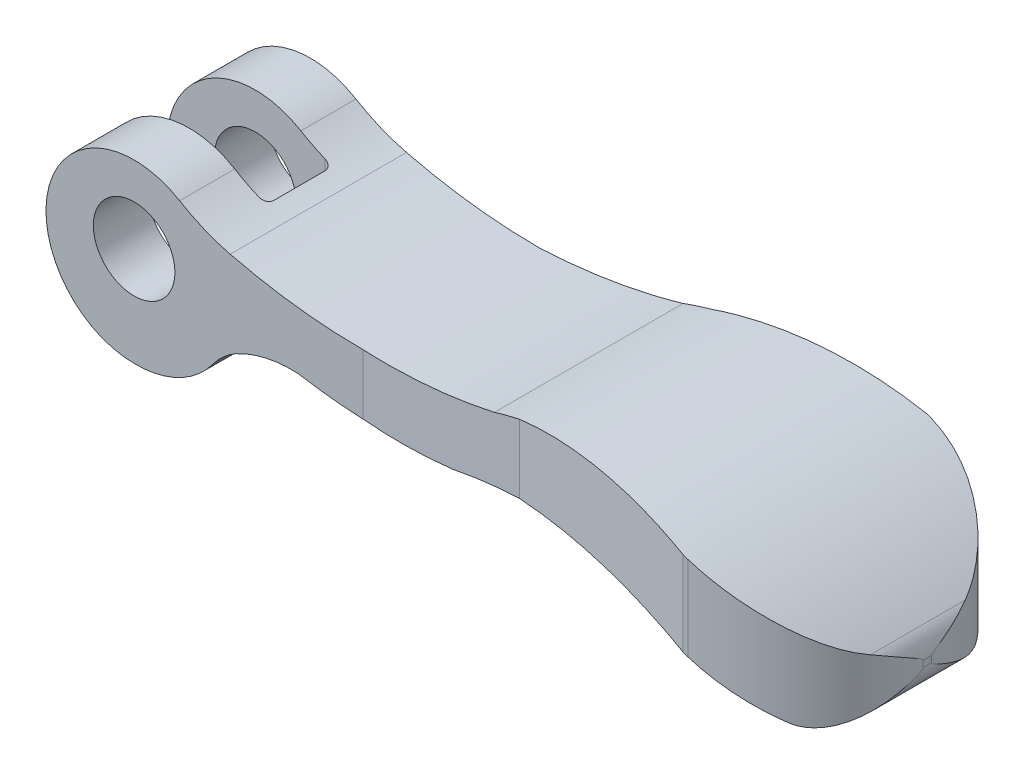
ISO-10303-21;
HEADER;
FILE_DESCRIPTION(('STEP AP214'),'2;1');
FILE_NAME('part.step','',(''),(''),'','','');
FILE_SCHEMA(('AUTOMOTIVE_DESIGN { 1 0 10303 214 1 1 1 1 }'));
ENDSEC;
DATA;
#1=APPLICATION_CONTEXT('core data for automotive mechanical design processes');
#2=APPLICATION_PROTOCOL_DEFINITION('international standard','automotive_design',2000,#1);
#3=PRODUCT_CONTEXT('',#1,'mechanical');
#4=PRODUCT('Part','Part','',(#3));
#5=PRODUCT_RELATED_PRODUCT_CATEGORY('part','',(#4));
#6=PRODUCT_DEFINITION_FORMATION('','',#4);
#7=PRODUCT_DEFINITION_CONTEXT('part definition',#1,'design');
#8=PRODUCT_DEFINITION('design','',#6,#7);
#9=PRODUCT_DEFINITION_SHAPE('','',#8);
#10=(LENGTH_UNIT() NAMED_UNIT(*) SI_UNIT(.MILLI.,.METRE.));
#11=(NAMED_UNIT(*) PLANE_ANGLE_UNIT() SI_UNIT($,.RADIAN.));
#12=(NAMED_UNIT(*) SI_UNIT($,.STERADIAN.) SOLID_ANGLE_UNIT());
#13=UNCERTAINTY_MEASURE_WITH_UNIT(LENGTH_MEASURE(1.E-05),#10,'distance_accuracy_value','');
#14=(GEOMETRIC_REPRESENTATION_CONTEXT(3) GLOBAL_UNCERTAINTY_ASSIGNED_CONTEXT((#13)) GLOBAL_UNIT_ASSIGNED_CONTEXT((#10,
#11,#12)) REPRESENTATION_CONTEXT('',''));
#15=CARTESIAN_POINT('',(0.,0.,0.));
#16=DIRECTION('',(0.,0.,1.));
#17=DIRECTION('',(1.,0.,0.));
#18=AXIS2_PLACEMENT_3D('',#15,#16,#17);
#19=CARTESIAN_POINT('',(9.5,14.015,3.5));
#20=DIRECTION('',(0.,-1.,0.));
#21=DIRECTION('',(0.,0.,-1.));
#22=AXIS2_PLACEMENT_3D('',#19,#20,#21);
#23=CYLINDRICAL_SURFACE('',#22,1.);
#24=CARTESIAN_POINT('',(9.5,-9.66115949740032,4.5));
#25=CARTESIAN_POINT('',(9.5403006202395,-9.6205642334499,4.49998586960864));
#26=CARTESIAN_POINT('',(9.58032202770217,-9.57970448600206,4.49756367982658));
#27=CARTESIAN_POINT('',(9.65957717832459,-9.49772355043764,4.48799628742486));
#28=CARTESIAN_POINT('',(9.69881041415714,-9.45660221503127,4.48084813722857));
#29=CARTESIAN_POINT('',(9.7765741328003,-9.37402936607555,4.46183290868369));
#30=CARTESIAN_POINT('',(9.815094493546,-9.3325783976,4.44992194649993));
#31=CARTESIAN_POINT('',(9.89076927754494,-9.25009390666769,4.4213760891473));
#32=CARTESIAN_POINT('',(9.92792420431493,-9.20906023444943,4.40474295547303));
#33=CARTESIAN_POINT('',(10.0183790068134,-9.10790321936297,4.35733458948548));
#34=CARTESIAN_POINT('',(10.0706996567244,-9.04824618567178,4.32362010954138));
#35=CARTESIAN_POINT('',(10.1703473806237,-8.93263370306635,4.24475557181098));
#36=CARTESIAN_POINT('',(10.2176910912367,-8.87666617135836,4.1996454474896));
#37=CARTESIAN_POINT('',(10.2896783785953,-8.79026278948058,4.11505206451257));
#38=CARTESIAN_POINT('',(10.3163803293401,-8.75786028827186,4.07933710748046));
#39=CARTESIAN_POINT('',(10.3659816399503,-8.69714316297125,4.00217027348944));
#40=CARTESIAN_POINT('',(10.3888849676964,-8.66882427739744,3.96072446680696));
#41=CARTESIAN_POINT('',(10.4247174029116,-8.62421181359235,3.88247210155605));
#42=CARTESIAN_POINT('',(10.4387244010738,-8.60665815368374,3.84688613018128));
#43=CARTESIAN_POINT('',(10.4629107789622,-8.57622618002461,3.77261663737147));
#44=CARTESIAN_POINT('',(10.4731021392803,-8.56333323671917,3.73394328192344));
#45=CARTESIAN_POINT('',(10.4871593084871,-8.54551082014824,3.6628631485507));
#46=CARTESIAN_POINT('',(10.4919175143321,-8.53946082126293,3.63091569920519));
#47=CARTESIAN_POINT('',(10.498364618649,-8.5312543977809,3.5660038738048));
#48=CARTESIAN_POINT('',(10.5000321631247,-8.52912506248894,3.53303401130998));
#49=CARTESIAN_POINT('',(10.5,-8.52917065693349,3.5));
#50=B_SPLINE_CURVE_WITH_KNOTS('',3,(#24,#25,#26,#27,#28,#29,#30,#31,#32,#33,#34,#35,#36,#37,#38,
#39,#40,#41,#42,#43,#44,#45,#46,#47,#48,#49),.UNSPECIFIED.,.F.,.F.,(4,2,2,2,2,2,2,2,2,2,2,2,4),
(0.,0.171542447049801,0.343191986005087,0.516460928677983,0.689665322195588,0.947477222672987,
1.20439791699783,1.36932919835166,1.53408709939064,1.65988402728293,1.78528258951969,
1.88349249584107,1.98237846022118),.UNSPECIFIED.);
#51=CARTESIAN_POINT('',(9.5,-9.66115949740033,4.5));
#52=VERTEX_POINT('',#51);
#53=CARTESIAN_POINT('',(10.5,-8.52917065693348,3.5));
#54=VERTEX_POINT('',#53);
#55=EDGE_CURVE('E205',#52,#54,#50,.T.);
#56=ORIENTED_EDGE('',*,*,#55,.F.);
#57=DIRECTION('',(0.,1.,0.));
#58=VECTOR('',#57,1.);
#59=CARTESIAN_POINT('',(9.5,14.015,4.5));
#60=LINE('',#59,#58);
#61=CARTESIAN_POINT('',(9.5,7.10349602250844,4.5));
#62=VERTEX_POINT('',#61);
#63=EDGE_CURVE('E204',#52,#62,#60,.T.);
#64=ORIENTED_EDGE('',*,*,#63,.T.);
#65=CARTESIAN_POINT('',(10.5,6.71201628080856,3.5));
#66=CARTESIAN_POINT('',(10.5000006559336,6.71201631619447,3.52684790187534));
#67=CARTESIAN_POINT('',(10.4989180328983,6.71241323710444,3.55368252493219));
#68=CARTESIAN_POINT('',(10.494604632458,6.71399643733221,3.60715087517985));
#69=CARTESIAN_POINT('',(10.4913741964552,6.71518259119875,3.63378463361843));
#70=CARTESIAN_POINT('',(10.4785156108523,6.71990841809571,3.71296750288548));
#71=CARTESIAN_POINT('',(10.4657199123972,6.72461552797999,3.76497138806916));
#72=CARTESIAN_POINT('',(10.4321658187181,6.73701001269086,3.86592460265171));
#73=CARTESIAN_POINT('',(10.4114078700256,6.74469722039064,3.91487410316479));
#74=CARTESIAN_POINT('',(10.3626818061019,6.7628422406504,4.00849246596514));
#75=CARTESIAN_POINT('',(10.334711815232,6.7733007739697,4.0531602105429));
#76=CARTESIAN_POINT('',(10.2717796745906,6.79699170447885,4.13813598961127));
#77=CARTESIAN_POINT('',(10.2366686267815,6.81028352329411,4.17831687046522));
#78=CARTESIAN_POINT('',(10.1610237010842,6.83914777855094,4.25222713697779));
#79=CARTESIAN_POINT('',(10.1204887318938,6.85472067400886,4.28595522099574));
#80=CARTESIAN_POINT('',(10.032693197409,6.88874408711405,4.34811352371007));
#81=CARTESIAN_POINT('',(9.98517859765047,6.90730928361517,4.37612159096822));
#82=CARTESIAN_POINT('',(9.88676305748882,6.94613922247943,4.42380000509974));
#83=CARTESIAN_POINT('',(9.83586050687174,6.96640477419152,4.44346635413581));
#84=CARTESIAN_POINT('',(9.73760702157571,7.00591659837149,4.47256305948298));
#85=CARTESIAN_POINT('',(9.6904607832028,7.02503903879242,4.4828650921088));
#86=CARTESIAN_POINT('',(9.59551914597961,7.06388925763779,4.4965831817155));
#87=CARTESIAN_POINT('',(9.54772504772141,7.08361590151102,4.50001142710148));
#88=CARTESIAN_POINT('',(9.5,7.10349602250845,4.5));
#89=B_SPLINE_CURVE_WITH_KNOTS('',3,(#65,#66,#67,#68,#69,#70,#71,#72,#73,#74,#75,#76,#77,#78,#79,
#80,#81,#82,#83,#84,#85,#86,#87,#88),.UNSPECIFIED.,.F.,.F.,(4,2,2,2,2,2,2,2,2,2,2,4),(0.,
0.0804927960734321,0.160972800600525,0.321420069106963,0.481858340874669,0.642338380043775,
0.806590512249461,0.97087574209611,1.14471472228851,1.31863692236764,1.47390366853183,
1.62889485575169),.UNSPECIFIED.);
#90=CARTESIAN_POINT('',(10.5,6.71201628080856,3.5));
#91=VERTEX_POINT('',#90);
#92=EDGE_CURVE('E18',#91,#62,#89,.T.);
#93=ORIENTED_EDGE('',*,*,#92,.F.);
#94=DIRECTION('',(0.,1.,0.));
#95=VECTOR('',#94,1.);
#96=CARTESIAN_POINT('',(10.5,14.015,3.5));
#97=LINE('',#96,#95);
#98=EDGE_CURVE('E209',#91,#54,#97,.F.);
#99=ORIENTED_EDGE('',*,*,#98,.T.);
#100=EDGE_LOOP('',(#56,#64,#93,#99));
#101=FACE_BOUND('',#100,.T.);
#102=ADVANCED_FACE('F14',(#101),#23,.F.);
#103=CARTESIAN_POINT('',(9.5,14.015,-3.5));
#104=DIRECTION('',(0.,-1.,0.));
#105=DIRECTION('',(0.,0.,-1.));
#106=AXIS2_PLACEMENT_3D('',#103,#104,#105);
#107=CYLINDRICAL_SURFACE('',#106,1.);
#108=CARTESIAN_POINT('',(10.5,-8.52917065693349,-3.5));
#109=CARTESIAN_POINT('',(10.5000040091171,-8.52916480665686,-3.52111357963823));
#110=CARTESIAN_POINT('',(10.4993307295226,-8.53002343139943,-3.54221151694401));
#111=CARTESIAN_POINT('',(10.496672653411,-8.53340870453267,-3.58416292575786));
#112=CARTESIAN_POINT('',(10.4946895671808,-8.53593317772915,-3.6050166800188));
#113=CARTESIAN_POINT('',(10.4869043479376,-8.54583244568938,-3.66644652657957));
#114=CARTESIAN_POINT('',(10.4792637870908,-8.55553651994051,-3.70644058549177));
#115=CARTESIAN_POINT('',(10.4598188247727,-8.58011843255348,-3.78341509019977));
#116=CARTESIAN_POINT('',(10.4480345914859,-8.5949712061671,-3.82040908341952));
#117=CARTESIAN_POINT('',(10.4210653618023,-8.62876529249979,-3.8912547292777));
#118=CARTESIAN_POINT('',(10.4058691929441,-8.6477200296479,-3.92509552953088));
#119=CARTESIAN_POINT('',(10.36348657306,-8.70022435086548,-4.00753406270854));
#120=CARTESIAN_POINT('',(10.334364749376,-8.73598482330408,-4.05372057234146));
#121=CARTESIAN_POINT('',(10.2715099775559,-8.81220296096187,-4.13840626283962));
#122=CARTESIAN_POINT('',(10.2377663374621,-8.85267148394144,-4.17688709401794));
#123=CARTESIAN_POINT('',(10.1491873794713,-8.95746937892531,-4.26428640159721));
#124=CARTESIAN_POINT('',(10.0922247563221,-9.02363486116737,-4.30884207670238));
#125=CARTESIAN_POINT('',(9.97303102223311,-9.15908017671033,-4.38385698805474));
#126=CARTESIAN_POINT('',(9.910792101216,-9.22836455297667,-4.41429488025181));
#127=CARTESIAN_POINT('',(9.79101580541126,-9.3587320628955,-4.45855066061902));
#128=CARTESIAN_POINT('',(9.7339492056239,-9.41968458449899,-4.4740370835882));
#129=CARTESIAN_POINT('',(9.64700339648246,-9.51074394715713,-4.48957065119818));
#130=CARTESIAN_POINT('',(9.61787708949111,-9.54095491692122,-4.49346559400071));
#131=CARTESIAN_POINT('',(9.55921912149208,-9.60120905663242,-4.49867820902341));
#132=CARTESIAN_POINT('',(9.52968743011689,-9.63125221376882,-4.49999568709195));
#133=CARTESIAN_POINT('',(9.5,-9.66115949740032,-4.5));
#134=B_SPLINE_CURVE_WITH_KNOTS('',3,(#108,#109,#110,#111,#112,#113,#114,#115,#116,#117,#118,
#119,#120,#121,#122,#123,#124,#125,#126,#127,#128,#129,#130,#131,#132,#133),.UNSPECIFIED.,.F.,
.F.,(4,2,2,2,2,2,2,2,2,2,2,2,4),(0.,0.06328376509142,0.126485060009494,0.251269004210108,
0.375453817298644,0.500051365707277,0.694759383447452,0.889925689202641,1.18240611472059,
1.47532729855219,1.72941040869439,1.85577555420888,1.98215021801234),.UNSPECIFIED.);
#135=CARTESIAN_POINT('',(10.5,-8.52917065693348,-3.5));
#136=VERTEX_POINT('',#135);
#137=CARTESIAN_POINT('',(9.5,-9.66115949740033,-4.5));
#138=VERTEX_POINT('',#137);
#139=EDGE_CURVE('E226',#136,#138,#134,.T.);
#140=ORIENTED_EDGE('',*,*,#139,.F.);
#141=DIRECTION('',(0.,1.,0.));
#142=VECTOR('',#141,1.);
#143=CARTESIAN_POINT('',(10.5,14.015,-3.5));
#144=LINE('',#143,#142);
#145=CARTESIAN_POINT('',(10.5,6.71201628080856,-3.5));
#146=VERTEX_POINT('',#145);
#147=EDGE_CURVE('E498',#136,#146,#144,.T.);
#148=ORIENTED_EDGE('',*,*,#147,.T.);
#149=CARTESIAN_POINT('',(9.5,7.10349602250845,-4.5));
#150=CARTESIAN_POINT('',(9.55913079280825,7.07885961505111,-4.50003419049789));
#151=CARTESIAN_POINT('',(9.61839162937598,7.05445645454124,-4.49475539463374));
#152=CARTESIAN_POINT('',(9.73558779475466,7.00670320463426,-4.47366999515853));
#153=CARTESIAN_POINT('',(9.79352013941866,6.98335538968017,-4.45784171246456));
#154=CARTESIAN_POINT('',(9.90630993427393,6.93836870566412,-4.41572117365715));
#155=CARTESIAN_POINT('',(9.96116208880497,6.91673275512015,-4.38941148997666));
#156=CARTESIAN_POINT('',(10.0657751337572,6.87585995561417,-4.32680526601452));
#157=CARTESIAN_POINT('',(10.1155414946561,6.85662052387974,-4.29051961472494));
#158=CARTESIAN_POINT('',(10.2059055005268,6.82197534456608,-4.21074203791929));
#159=CARTESIAN_POINT('',(10.2468290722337,6.80642968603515,-4.1676808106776));
#160=CARTESIAN_POINT('',(10.3207933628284,6.77851416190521,-4.07431753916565));
#161=CARTESIAN_POINT('',(10.3538340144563,6.76614432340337,-4.02401543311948));
#162=CARTESIAN_POINT('',(10.4086061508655,6.74573486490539,-3.92140587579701));
#163=CARTESIAN_POINT('',(10.4309625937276,6.73745460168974,-3.86947885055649));
#164=CARTESIAN_POINT('',(10.4666477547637,6.72427266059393,-3.76224498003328));
#165=CARTESIAN_POINT('',(10.4799907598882,6.71936563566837,-3.70694363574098));
#166=CARTESIAN_POINT('',(10.4923627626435,6.71481959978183,-3.62592587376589));
#167=CARTESIAN_POINT('',(10.4952261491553,6.71376829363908,-3.60081797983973));
#168=CARTESIAN_POINT('',(10.4990430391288,6.71236736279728,-3.55047778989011));
#169=CARTESIAN_POINT('',(10.4999995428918,6.7120166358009,-3.5252457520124));
#170=CARTESIAN_POINT('',(10.5000000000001,6.71201628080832,-3.5));
#171=B_SPLINE_CURVE_WITH_KNOTS('',3,(#149,#150,#151,#152,#153,#154,#155,#156,#157,#158,#159,
#160,#161,#162,#163,#164,#165,#166,#167,#168,#169,#170),.UNSPECIFIED.,.F.,.F.,(4,2,2,2,2,2,2,2,
2,2,4),(0.,0.192005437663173,0.384406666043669,0.577129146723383,0.769642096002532,
0.952892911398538,1.13614529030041,1.30670072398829,1.47698517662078,1.55279410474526,
1.62848366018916),.UNSPECIFIED.);
#172=CARTESIAN_POINT('',(9.5,7.10349602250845,-4.5));
#173=VERTEX_POINT('',#172);
#174=EDGE_CURVE('E202',#173,#146,#171,.T.);
#175=ORIENTED_EDGE('',*,*,#174,.F.);
#176=DIRECTION('',(0.,1.,0.));
#177=VECTOR('',#176,1.);
#178=CARTESIAN_POINT('',(9.5,14.015,-4.5));
#179=LINE('',#178,#177);
#180=EDGE_CURVE('E494',#173,#138,#179,.F.);
#181=ORIENTED_EDGE('',*,*,#180,.T.);
#182=EDGE_LOOP('',(#140,#148,#175,#181));
#183=FACE_BOUND('',#182,.T.);
#184=ADVANCED_FACE('F239',(#183),#107,.F.);
#185=CARTESIAN_POINT('',(9.5,14.015,4.5));
#186=DIRECTION('',(0.,0.,1.));
#187=DIRECTION('',(1.,0.,0.));
#188=AXIS2_PLACEMENT_3D('',#185,#186,#187);
#189=PLANE('',#188);
#190=ORIENTED_EDGE('',*,*,#63,.F.);
#191=CARTESIAN_POINT('',(0.273629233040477,-0.502880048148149,4.5));
#192=DIRECTION('',(0.,0.,-1.));
#193=DIRECTION('',(-1.,0.,0.));
#194=AXIS2_PLACEMENT_3D('',#191,#192,#193);
#195=CIRCLE('',#194,13.);
#196=CARTESIAN_POINT('',(-2.44785745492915E-13,-13.5,4.5));
#197=VERTEX_POINT('',#196);
#198=EDGE_CURVE('E493',#197,#52,#195,.F.);
#199=ORIENTED_EDGE('',*,*,#198,.F.);
#200=CARTESIAN_POINT('',(0.,-1.5,4.5));
#201=DIRECTION('',(0.,0.,-1.));
#202=DIRECTION('',(-1.,0.,0.));
#203=AXIS2_PLACEMENT_3D('',#200,#201,#202);
#204=CIRCLE('',#203,12.);
#205=CARTESIAN_POINT('',(6.19829910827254,8.77526584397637,4.5));
#206=VERTEX_POINT('',#205);
#207=EDGE_CURVE('E213',#206,#197,#204,.F.);
#208=ORIENTED_EDGE('',*,*,#207,.F.);
#209=CARTESIAN_POINT('',(19.1114222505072,30.1820696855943,4.5));
#210=DIRECTION('',(0.,0.,-1.));
#211=DIRECTION('',(-1.,0.,0.));
#212=AXIS2_PLACEMENT_3D('',#209,#210,#211);
#213=CIRCLE('',#212,25.0000000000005);
#214=EDGE_CURVE('E198',#206,#62,#213,.F.);
#215=ORIENTED_EDGE('',*,*,#214,.T.);
#216=EDGE_LOOP('',(#190,#199,#208,#215));
#217=FACE_BOUND('',#216,.T.);
#218=CARTESIAN_POINT('',(0.,0.,4.5));
#219=DIRECTION('',(0.,0.,-1.));
#220=DIRECTION('',(-1.,0.,0.));
#221=AXIS2_PLACEMENT_3D('',#218,#219,#220);
#222=CIRCLE('',#221,5.55);
#223=CARTESIAN_POINT('',(-5.55,0.,4.5));
#224=VERTEX_POINT('',#223);
#225=EDGE_CURVE('E497',#224,#224,#222,.F.);
#226=ORIENTED_EDGE('',*,*,#225,.T.);
#227=EDGE_LOOP('',(#226));
#228=FACE_BOUND('',#227,.T.);
#229=ADVANCED_FACE('F211',(#217,#228),#189,.F.);
#230=CARTESIAN_POINT('',(10.5,14.015,-3.5));
#231=DIRECTION('',(1.,0.,0.));
#232=DIRECTION('',(0.,0.,-1.));
#233=AXIS2_PLACEMENT_3D('',#230,#231,#232);
#234=PLANE('',#233);
#235=ORIENTED_EDGE('',*,*,#147,.F.);
#236=DIRECTION('',(0.,0.,-1.));
#237=VECTOR('',#236,1.);
#238=CARTESIAN_POINT('',(10.5,-8.52917065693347,16.6));
#239=LINE('',#238,#237);
#240=EDGE_CURVE('E233',#54,#136,#239,.T.);
#241=ORIENTED_EDGE('',*,*,#240,.F.);
#242=ORIENTED_EDGE('',*,*,#98,.F.);
#243=DIRECTION('',(0.,0.,-1.));
#244=VECTOR('',#243,1.);
#245=CARTESIAN_POINT('',(10.5,6.71201628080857,16.6));
#246=LINE('',#245,#244);
#247=EDGE_CURVE('E201',#91,#146,#246,.T.);
#248=ORIENTED_EDGE('',*,*,#247,.T.);
#249=EDGE_LOOP('',(#235,#241,#242,#248));
#250=FACE_BOUND('',#249,.T.);
#251=ADVANCED_FACE('F269',(#250),#234,.F.);
#252=CARTESIAN_POINT('',(-13.,14.015,-4.5));
#253=DIRECTION('',(0.,0.,-1.));
#254=DIRECTION('',(-1.,0.,0.));
#255=AXIS2_PLACEMENT_3D('',#252,#253,#254);
#256=PLANE('',#255);
#257=CARTESIAN_POINT('',(0.,-1.5,-4.5));
#258=DIRECTION('',(0.,0.,-1.));
#259=DIRECTION('',(-1.,0.,0.));
#260=AXIS2_PLACEMENT_3D('',#257,#258,#259);
#261=CIRCLE('',#260,12.);
#262=CARTESIAN_POINT('',(-2.44785745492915E-13,-13.5,-4.5));
#263=VERTEX_POINT('',#262);
#264=CARTESIAN_POINT('',(6.19829910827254,8.77526584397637,-4.5));
#265=VERTEX_POINT('',#264);
#266=EDGE_CURVE('E489',#263,#265,#261,.T.);
#267=ORIENTED_EDGE('',*,*,#266,.F.);
#268=CARTESIAN_POINT('',(0.273629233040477,-0.502880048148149,-4.5));
#269=DIRECTION('',(0.,0.,-1.));
#270=DIRECTION('',(-1.,0.,0.));
#271=AXIS2_PLACEMENT_3D('',#268,#269,#270);
#272=CIRCLE('',#271,13.);
#273=EDGE_CURVE('E223',#138,#263,#272,.T.);
#274=ORIENTED_EDGE('',*,*,#273,.F.);
#275=ORIENTED_EDGE('',*,*,#180,.F.);
#276=CARTESIAN_POINT('',(19.1114222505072,30.1820696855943,-4.5));
#277=DIRECTION('',(0.,0.,-1.));
#278=DIRECTION('',(-1.,0.,0.));
#279=AXIS2_PLACEMENT_3D('',#276,#277,#278);
#280=CIRCLE('',#279,25.0000000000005);
#281=EDGE_CURVE('E216',#173,#265,#280,.T.);
#282=ORIENTED_EDGE('',*,*,#281,.T.);
#283=EDGE_LOOP('',(#267,#274,#275,#282));
#284=FACE_BOUND('',#283,.T.);
#285=CARTESIAN_POINT('',(0.,0.,-4.5));
#286=DIRECTION('',(0.,0.,-1.));
#287=DIRECTION('',(-1.,0.,0.));
#288=AXIS2_PLACEMENT_3D('',#285,#286,#287);
#289=CIRCLE('',#288,5.55);
#290=CARTESIAN_POINT('',(-5.55,0.,-4.5));
#291=VERTEX_POINT('',#290);
#292=EDGE_CURVE('E506',#291,#291,#289,.T.);
#293=ORIENTED_EDGE('',*,*,#292,.T.);
#294=EDGE_LOOP('',(#293));
#295=FACE_BOUND('',#294,.T.);
#296=ADVANCED_FACE('F265',(#284,#295),#256,.F.);
#297=CARTESIAN_POINT('',(0.,0.,16.6));
#298=DIRECTION('',(0.,0.,-1.));
#299=DIRECTION('',(-1.,0.,0.));
#300=AXIS2_PLACEMENT_3D('',#297,#298,#299);
#301=CYLINDRICAL_SURFACE('',#300,5.55);
#302=CARTESIAN_POINT('',(0.,0.,12.));
#303=DIRECTION('',(0.,0.,-1.));
#304=DIRECTION('',(-1.,0.,0.));
#305=AXIS2_PLACEMENT_3D('',#302,#303,#304);
#306=CIRCLE('',#305,5.55);
#307=CARTESIAN_POINT('',(-5.55,0.,12.));
#308=VERTEX_POINT('',#307);
#309=EDGE_CURVE('E472',#308,#308,#306,.F.);
#310=ORIENTED_EDGE('',*,*,#309,.T.);
#311=EDGE_LOOP('',(#310));
#312=FACE_BOUND('',#311,.T.);
#313=ORIENTED_EDGE('',*,*,#225,.F.);
#314=EDGE_LOOP('',(#313));
#315=FACE_BOUND('',#314,.T.);
#316=ADVANCED_FACE('F261',(#312,#315),#301,.F.);
#317=CARTESIAN_POINT('',(0.,-1.5,16.6));
#318=DIRECTION('',(0.,0.,-1.));
#319=DIRECTION('',(-1.,0.,0.));
#320=AXIS2_PLACEMENT_3D('',#317,#318,#319);
#321=CYLINDRICAL_SURFACE('',#320,12.);
#322=DIRECTION('',(0.,0.,-1.));
#323=VECTOR('',#322,1.);
#324=CARTESIAN_POINT('',(6.19829910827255,8.77526584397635,16.6));
#325=LINE('',#324,#323);
#326=CARTESIAN_POINT('',(6.19829910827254,8.77526584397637,12.));
#327=VERTEX_POINT('',#326);
#328=EDGE_CURVE('E214',#327,#206,#325,.T.);
#329=ORIENTED_EDGE('',*,*,#328,.T.);
#330=ORIENTED_EDGE('',*,*,#207,.T.);
#331=DIRECTION('',(0.,0.,-1.));
#332=VECTOR('',#331,1.);
#333=CARTESIAN_POINT('',(0.,-13.5,16.6));
#334=LINE('',#333,#332);
#335=CARTESIAN_POINT('',(-2.44785745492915E-13,-13.5,12.));
#336=VERTEX_POINT('',#335);
#337=EDGE_CURVE('E488',#336,#197,#334,.T.);
#338=ORIENTED_EDGE('',*,*,#337,.F.);
#339=CARTESIAN_POINT('',(0.,-1.5,12.));
#340=DIRECTION('',(0.,0.,-1.));
#341=DIRECTION('',(-1.,0.,0.));
#342=AXIS2_PLACEMENT_3D('',#339,#340,#341);
#343=CIRCLE('',#342,12.);
#344=EDGE_CURVE('E460',#336,#327,#343,.T.);
#345=ORIENTED_EDGE('',*,*,#344,.T.);
#346=EDGE_LOOP('',(#329,#330,#338,#345));
#347=FACE_BOUND('',#346,.T.);
#348=ADVANCED_FACE('F257',(#347),#321,.T.);
#349=CARTESIAN_POINT('',(0.,0.,16.6));
#350=DIRECTION('',(0.,0.,-1.));
#351=DIRECTION('',(-1.,0.,0.));
#352=AXIS2_PLACEMENT_3D('',#349,#350,#351);
#353=CYLINDRICAL_SURFACE('',#352,5.55);
#354=CARTESIAN_POINT('',(0.,0.,-12.));
#355=DIRECTION('',(0.,0.,-1.));
#356=DIRECTION('',(-1.,0.,0.));
#357=AXIS2_PLACEMENT_3D('',#354,#355,#356);
#358=CIRCLE('',#357,5.55);
#359=CARTESIAN_POINT('',(-5.55,0.,-12.));
#360=VERTEX_POINT('',#359);
#361=EDGE_CURVE('E448',#360,#360,#358,.T.);
#362=ORIENTED_EDGE('',*,*,#361,.T.);
#363=EDGE_LOOP('',(#362));
#364=FACE_BOUND('',#363,.T.);
#365=ORIENTED_EDGE('',*,*,#292,.F.);
#366=EDGE_LOOP('',(#365));
#367=FACE_BOUND('',#366,.T.);
#368=ADVANCED_FACE('F253',(#364,#367),#353,.F.);
#369=CARTESIAN_POINT('',(0.,-1.5,16.6));
#370=DIRECTION('',(0.,0.,-1.));
#371=DIRECTION('',(-1.,0.,0.));
#372=AXIS2_PLACEMENT_3D('',#369,#370,#371);
#373=CYLINDRICAL_SURFACE('',#372,12.);
#374=DIRECTION('',(0.,0.,-1.));
#375=VECTOR('',#374,1.);
#376=CARTESIAN_POINT('',(0.,-13.5,16.6));
#377=LINE('',#376,#375);
#378=CARTESIAN_POINT('',(-2.44758640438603E-13,-13.5,-12.));
#379=VERTEX_POINT('',#378);
#380=EDGE_CURVE('E487',#263,#379,#377,.T.);
#381=ORIENTED_EDGE('',*,*,#380,.F.);
#382=ORIENTED_EDGE('',*,*,#266,.T.);
#383=DIRECTION('',(0.,0.,-1.));
#384=VECTOR('',#383,1.);
#385=CARTESIAN_POINT('',(6.19829910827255,8.77526584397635,16.6));
#386=LINE('',#385,#384);
#387=CARTESIAN_POINT('',(6.19829910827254,8.77526584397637,-12.));
#388=VERTEX_POINT('',#387);
#389=EDGE_CURVE('E477',#265,#388,#386,.T.);
#390=ORIENTED_EDGE('',*,*,#389,.T.);
#391=CARTESIAN_POINT('',(0.,-1.5,-12.));
#392=DIRECTION('',(0.,0.,-1.));
#393=DIRECTION('',(-1.,0.,0.));
#394=AXIS2_PLACEMENT_3D('',#391,#392,#393);
#395=CIRCLE('',#394,12.);
#396=EDGE_CURVE('E442',#388,#379,#395,.F.);
#397=ORIENTED_EDGE('',*,*,#396,.T.);
#398=EDGE_LOOP('',(#381,#382,#390,#397));
#399=FACE_BOUND('',#398,.T.);
#400=ADVANCED_FACE('F248',(#399),#373,.T.);
#401=CARTESIAN_POINT('',(0.273629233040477,-0.502880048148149,16.6));
#402=DIRECTION('',(0.,0.,-1.));
#403=DIRECTION('',(-1.,0.,0.));
#404=AXIS2_PLACEMENT_3D('',#401,#402,#403);
#405=CYLINDRICAL_SURFACE('',#404,13.);
#406=ORIENTED_EDGE('',*,*,#139,.T.);
#407=ORIENTED_EDGE('',*,*,#273,.T.);
#408=ORIENTED_EDGE('',*,*,#380,.T.);
#409=CARTESIAN_POINT('',(0.273629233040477,-0.502880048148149,-12.));
#410=DIRECTION('',(0.,0.,-1.));
#411=DIRECTION('',(-1.,0.,0.));
#412=AXIS2_PLACEMENT_3D('',#409,#410,#411);
#413=CIRCLE('',#412,13.);
#414=CARTESIAN_POINT('',(10.7499999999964,-8.20000000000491,-12.));
#415=VERTEX_POINT('',#414);
#416=EDGE_CURVE('E439',#379,#415,#413,.F.);
#417=ORIENTED_EDGE('',*,*,#416,.T.);
#418=DIRECTION('',(0.,0.,-1.));
#419=VECTOR('',#418,1.);
#420=CARTESIAN_POINT('',(10.7499999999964,-8.20000000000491,16.6));
#421=LINE('',#420,#419);
#422=CARTESIAN_POINT('',(10.7499999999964,-8.2000000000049,12.));
#423=VERTEX_POINT('',#422);
#424=EDGE_CURVE('E218',#415,#423,#421,.F.);
#425=ORIENTED_EDGE('',*,*,#424,.T.);
#426=CARTESIAN_POINT('',(0.273629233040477,-0.502880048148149,12.));
#427=DIRECTION('',(0.,0.,-1.));
#428=DIRECTION('',(-1.,0.,0.));
#429=AXIS2_PLACEMENT_3D('',#426,#427,#428);
#430=CIRCLE('',#429,13.);
#431=EDGE_CURVE('E463',#423,#336,#430,.T.);
#432=ORIENTED_EDGE('',*,*,#431,.T.);
#433=ORIENTED_EDGE('',*,*,#337,.T.);
#434=ORIENTED_EDGE('',*,*,#198,.T.);
#435=ORIENTED_EDGE('',*,*,#55,.T.);
#436=ORIENTED_EDGE('',*,*,#240,.T.);
#437=EDGE_LOOP('',(#406,#407,#408,#417,#425,#432,#433,#434,#435,#436));
#438=FACE_BOUND('',#437,.T.);
#439=ADVANCED_FACE('F242',(#438),#405,.T.);
#440=CARTESIAN_POINT('',(18.8217799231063,-14.1200058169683,16.6));
#441=DIRECTION('',(0.,0.,-1.));
#442=DIRECTION('',(-1.,0.,0.));
#443=AXIS2_PLACEMENT_3D('',#440,#441,#442);
#444=CYLINDRICAL_SURFACE('',#443,10.01);
#445=DIRECTION('',(0.,0.,-1.));
#446=VECTOR('',#445,1.);
#447=CARTESIAN_POINT('',(13.8627785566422,-5.42469642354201,16.6));
#448=LINE('',#447,#446);
#449=CARTESIAN_POINT('',(13.8627785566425,-5.42469642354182,-12.));
#450=VERTEX_POINT('',#449);
#451=CARTESIAN_POINT('',(13.8627785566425,-5.42469642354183,12.));
#452=VERTEX_POINT('',#451);
#453=EDGE_CURVE('E474',#450,#452,#448,.F.);
#454=ORIENTED_EDGE('',*,*,#453,.T.);
#455=CARTESIAN_POINT('',(18.8217799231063,-14.1200058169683,12.));
#456=DIRECTION('',(0.,0.,-1.));
#457=DIRECTION('',(-1.,0.,0.));
#458=AXIS2_PLACEMENT_3D('',#455,#456,#457);
#459=CIRCLE('',#458,10.01);
#460=EDGE_CURVE('E466',#452,#423,#459,.F.);
#461=ORIENTED_EDGE('',*,*,#460,.T.);
#462=ORIENTED_EDGE('',*,*,#424,.F.);
#463=CARTESIAN_POINT('',(18.8217799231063,-14.1200058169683,-12.));
#464=DIRECTION('',(0.,0.,-1.));
#465=DIRECTION('',(-1.,0.,0.));
#466=AXIS2_PLACEMENT_3D('',#463,#464,#465);
#467=CIRCLE('',#466,10.01);
#468=EDGE_CURVE('E436',#415,#450,#467,.T.);
#469=ORIENTED_EDGE('',*,*,#468,.T.);
#470=EDGE_LOOP('',(#454,#461,#462,#469));
#471=FACE_BOUND('',#470,.T.);
#472=ADVANCED_FACE('F247',(#471),#444,.F.);
#473=CARTESIAN_POINT('',(19.1114222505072,30.1820696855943,16.6));
#474=DIRECTION('',(0.,0.,-1.));
#475=DIRECTION('',(-1.,0.,0.));
#476=AXIS2_PLACEMENT_3D('',#473,#474,#475);
#477=CYLINDRICAL_SURFACE('',#476,25.0000000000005);
#478=ORIENTED_EDGE('',*,*,#389,.F.);
#479=ORIENTED_EDGE('',*,*,#281,.F.);
#480=ORIENTED_EDGE('',*,*,#174,.T.);
#481=ORIENTED_EDGE('',*,*,#247,.F.);
#482=ORIENTED_EDGE('',*,*,#92,.T.);
#483=ORIENTED_EDGE('',*,*,#214,.F.);
#484=ORIENTED_EDGE('',*,*,#328,.F.);
#485=CARTESIAN_POINT('',(19.1114222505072,30.1820696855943,12.));
#486=DIRECTION('',(0.,0.,-1.));
#487=DIRECTION('',(-1.,0.,0.));
#488=AXIS2_PLACEMENT_3D('',#485,#486,#487);
#489=CIRCLE('',#488,25.0000000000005);
#490=CARTESIAN_POINT('',(13.0826643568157,5.91987526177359,12.));
#491=VERTEX_POINT('',#490);
#492=EDGE_CURVE('E458',#327,#491,#489,.F.);
#493=ORIENTED_EDGE('',*,*,#492,.T.);
#494=DIRECTION('',(0.,0.,-1.));
#495=VECTOR('',#494,1.);
#496=CARTESIAN_POINT('',(13.0826643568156,5.91987526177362,16.6));
#497=LINE('',#496,#495);
#498=CARTESIAN_POINT('',(13.0826643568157,5.91987526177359,-12.));
#499=VERTEX_POINT('',#498);
#500=EDGE_CURVE('E423',#491,#499,#497,.T.);
#501=ORIENTED_EDGE('',*,*,#500,.T.);
#502=CARTESIAN_POINT('',(19.1114222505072,30.1820696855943,-12.));
#503=DIRECTION('',(0.,0.,-1.));
#504=DIRECTION('',(-1.,0.,0.));
#505=AXIS2_PLACEMENT_3D('',#502,#503,#504);
#506=CIRCLE('',#505,25.0000000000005);
#507=EDGE_CURVE('E445',#499,#388,#506,.T.);
#508=ORIENTED_EDGE('',*,*,#507,.T.);
#509=EDGE_LOOP('',(#478,#479,#480,#481,#482,#483,#484,#493,#501,#508));
#510=FACE_BOUND('',#509,.T.);
#511=ADVANCED_FACE('F196',(#510),#477,.F.);
#512=CARTESIAN_POINT('',(21.45,-19.5,16.6));
#513=DIRECTION('',(0.,0.,-1.));
#514=DIRECTION('',(-1.,0.,0.));
#515=AXIS2_PLACEMENT_3D('',#512,#513,#514);
#516=CYLINDRICAL_SURFACE('',#515,15.99);
#517=DIRECTION('',(0.,0.,-1.));
#518=VECTOR('',#517,1.);
#519=CARTESIAN_POINT('',(22.384949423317,-3.53735706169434,16.6));
#520=LINE('',#519,#518);
#521=CARTESIAN_POINT('',(22.384949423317,-3.53735706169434,12.));
#522=VERTEX_POINT('',#521);
#523=CARTESIAN_POINT('',(22.384949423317,-3.53735706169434,-12.));
#524=VERTEX_POINT('',#523);
#525=EDGE_CURVE('E419',#522,#524,#520,.T.);
#526=ORIENTED_EDGE('',*,*,#525,.F.);
#527=CARTESIAN_POINT('',(21.45,-19.5,12.));
#528=DIRECTION('',(0.,0.,-1.));
#529=DIRECTION('',(-1.,0.,0.));
#530=AXIS2_PLACEMENT_3D('',#527,#528,#529);
#531=CIRCLE('',#530,15.99);
#532=EDGE_CURVE('E469',#522,#452,#531,.F.);
#533=ORIENTED_EDGE('',*,*,#532,.T.);
#534=ORIENTED_EDGE('',*,*,#453,.F.);
#535=CARTESIAN_POINT('',(21.45,-19.5,-12.));
#536=DIRECTION('',(0.,0.,-1.));
#537=DIRECTION('',(-1.,0.,0.));
#538=AXIS2_PLACEMENT_3D('',#535,#536,#537);
#539=CIRCLE('',#538,15.99);
#540=EDGE_CURVE('E433',#450,#524,#539,.T.);
#541=ORIENTED_EDGE('',*,*,#540,.T.);
#542=EDGE_LOOP('',(#526,#533,#534,#541));
#543=FACE_BOUND('',#542,.T.);
#544=ADVANCED_FACE('F522',(#543),#516,.F.);
#545=CARTESIAN_POINT('',(-13.,14.015,12.));
#546=DIRECTION('',(0.,0.,-1.));
#547=DIRECTION('',(-1.,0.,0.));
#548=AXIS2_PLACEMENT_3D('',#545,#546,#547);
#549=PLANE('',#548);
#550=ORIENTED_EDGE('',*,*,#492,.F.);
#551=ORIENTED_EDGE('',*,*,#344,.F.);
#552=ORIENTED_EDGE('',*,*,#431,.F.);
#553=ORIENTED_EDGE('',*,*,#460,.F.);
#554=ORIENTED_EDGE('',*,*,#532,.F.);
#555=CARTESIAN_POINT('',(33.71,60.57,12.));
#556=DIRECTION('',(0.,0.,-1.));
#557=DIRECTION('',(-1.,0.,0.));
#558=AXIS2_PLACEMENT_3D('',#555,#556,#557);
#559=CIRCLE('',#558,65.1);
#560=CARTESIAN_POINT('',(31.14,-4.47925134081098,12.));
#561=VERTEX_POINT('',#560);
#562=EDGE_CURVE('E399',#561,#522,#559,.T.);
#563=ORIENTED_EDGE('',*,*,#562,.F.);
#564=DIRECTION('',(0.,1.,0.));
#565=VECTOR('',#564,1.);
#566=CARTESIAN_POINT('',(31.14,14.015,12.));
#567=LINE('',#566,#565);
#568=CARTESIAN_POINT('',(31.14,3.71,12.));
#569=VERTEX_POINT('',#568);
#570=EDGE_CURVE('E406',#561,#569,#567,.T.);
#571=ORIENTED_EDGE('',*,*,#570,.T.);
#572=CARTESIAN_POINT('',(31.14,78.59,12.));
#573=DIRECTION('',(0.,0.,-1.));
#574=DIRECTION('',(-1.,0.,0.));
#575=AXIS2_PLACEMENT_3D('',#572,#573,#574);
#576=CIRCLE('',#575,74.88);
#577=EDGE_CURVE('E424',#569,#491,#576,.T.);
#578=ORIENTED_EDGE('',*,*,#577,.T.);
#579=EDGE_LOOP('',(#550,#551,#552,#553,#554,#563,#571,#578));
#580=FACE_BOUND('',#579,.T.);
#581=ORIENTED_EDGE('',*,*,#309,.F.);
#582=EDGE_LOOP('',(#581));
#583=FACE_BOUND('',#582,.T.);
#584=ADVANCED_FACE('F526',(#580,#583),#549,.F.);
#585=CARTESIAN_POINT('',(19.1114222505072,30.1820696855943,16.6));
#586=DIRECTION('',(0.,0.,1.));
#587=DIRECTION('',(1.,0.,0.));
#588=AXIS2_PLACEMENT_3D('',#585,#586,#587);
#589=PLANE('',#588);
#590=DIRECTION('',(0.,1.,0.));
#591=VECTOR('',#590,1.);
#592=CARTESIAN_POINT('',(79.3282548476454,14.015,16.6));
#593=LINE('',#592,#591);
#594=CARTESIAN_POINT('',(79.3282548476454,5.92993649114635,16.6));
#595=VERTEX_POINT('',#594);
#596=CARTESIAN_POINT('',(79.3282548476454,-5.57263963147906,16.6));
#597=VERTEX_POINT('',#596);
#598=EDGE_CURVE('E569',#595,#597,#593,.F.);
#599=ORIENTED_EDGE('',*,*,#598,.T.);
#600=CARTESIAN_POINT('',(58.5,-64.5,16.6));
#601=DIRECTION('',(0.,0.,-1.));
#602=DIRECTION('',(-1.,0.,0.));
#603=AXIS2_PLACEMENT_3D('',#600,#601,#602);
#604=CIRCLE('',#603,62.5);
#605=CARTESIAN_POINT('',(79.976281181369,-5.80571282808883,16.6));
#606=VERTEX_POINT('',#605);
#607=EDGE_CURVE('E456',#597,#606,#604,.T.);
#608=ORIENTED_EDGE('',*,*,#607,.T.);
#609=DIRECTION('',(0.,-1.,0.));
#610=VECTOR('',#609,1.);
#611=CARTESIAN_POINT('',(79.976281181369,14.015,16.6));
#612=LINE('',#611,#610);
#613=CARTESIAN_POINT('',(79.976281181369,5.69583159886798,16.6));
#614=VERTEX_POINT('',#613);
#615=EDGE_CURVE('E563',#614,#606,#612,.T.);
#616=ORIENTED_EDGE('',*,*,#615,.F.);
#617=CARTESIAN_POINT('',(64.37,-36.49,16.6));
#618=DIRECTION('',(0.,0.,-1.));
#619=DIRECTION('',(-1.,0.,0.));
#620=AXIS2_PLACEMENT_3D('',#617,#618,#619);
#621=CIRCLE('',#620,44.98);
#622=EDGE_CURVE('E431',#595,#614,#621,.T.);
#623=ORIENTED_EDGE('',*,*,#622,.F.);
#624=EDGE_LOOP('',(#599,#608,#616,#623));
#625=FACE_BOUND('',#624,.T.);
#626=ADVANCED_FACE('F530',(#625),#589,.T.);
#627=CARTESIAN_POINT('',(92.,-6.22544151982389,16.6));
#628=DIRECTION('',(0.,0.,-1.));
#629=DIRECTION('',(-1.,0.,0.));
#630=AXIS2_PLACEMENT_3D('',#627,#628,#629);
#631=CYLINDRICAL_SURFACE('',#630,4.);
#632=DIRECTION('',(0.,0.,-1.));
#633=VECTOR('',#632,1.);
#634=CARTESIAN_POINT('',(94.696925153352,-3.27136049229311,16.6));
#635=LINE('',#634,#633);
#636=CARTESIAN_POINT('',(94.696925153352,-3.27136049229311,6.47272592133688));
#637=VERTEX_POINT('',#636);
#638=CARTESIAN_POINT('',(94.696925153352,-3.27136049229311,-6.47272592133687));
#639=VERTEX_POINT('',#638);
#640=EDGE_CURVE('E430',#637,#639,#635,.T.);
#641=ORIENTED_EDGE('',*,*,#640,.F.);
#642=CARTESIAN_POINT('',(96.,-6.22544151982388,0.576281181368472));
#643=CARTESIAN_POINT('',(96.0000009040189,-6.21663761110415,0.576249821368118));
#644=CARTESIAN_POINT('',(95.9999709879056,-6.20788018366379,0.577117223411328));
#645=CARTESIAN_POINT('',(95.9998586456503,-6.19079245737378,0.580342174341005));
#646=CARTESIAN_POINT('',(95.9997771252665,-6.18245741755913,0.582674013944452));
#647=CARTESIAN_POINT('',(95.9995270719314,-6.16285714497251,0.589759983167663));
#648=CARTESIAN_POINT('',(95.9993364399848,-6.15181733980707,0.595118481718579));
#649=CARTESIAN_POINT('',(95.9988897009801,-6.1306062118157,0.607454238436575));
#650=CARTESIAN_POINT('',(95.9986330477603,-6.12044312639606,0.614444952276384));
#651=CARTESIAN_POINT('',(95.9975392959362,-6.08225996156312,0.643618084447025));
#652=CARTESIAN_POINT('',(95.9965275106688,-6.05708659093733,0.669380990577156));
#653=CARTESIAN_POINT('',(95.9942554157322,-6.00988505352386,0.723576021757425));
#654=CARTESIAN_POINT('',(95.9929934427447,-5.98787973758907,0.752025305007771));
#655=CARTESIAN_POINT('',(95.9884957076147,-5.91837717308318,0.847508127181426));
#656=CARTESIAN_POINT('',(95.9848077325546,-5.87446597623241,0.917137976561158));
#657=CARTESIAN_POINT('',(95.9764128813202,-5.78967310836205,1.05817157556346));
#658=CARTESIAN_POINT('',(95.971703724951,-5.74879849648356,1.12957897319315));
#659=CARTESIAN_POINT('',(95.9612907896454,-5.66883820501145,1.27314336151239));
#660=CARTESIAN_POINT('',(95.955589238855,-5.62974876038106,1.34529833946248));
#661=CARTESIAN_POINT('',(95.9431974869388,-5.55260431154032,1.48996483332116));
#662=CARTESIAN_POINT('',(95.9365083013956,-5.51454829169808,1.56247590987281));
#663=CARTESIAN_POINT('',(95.9149273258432,-5.40125869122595,1.78062835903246));
#664=CARTESIAN_POINT('',(95.8985392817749,-5.3270325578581,1.92665075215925));
#665=CARTESIAN_POINT('',(95.8617666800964,-5.18023236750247,2.21902541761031));
#666=CARTESIAN_POINT('',(95.8413817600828,-5.10765846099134,2.3653777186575));
#667=CARTESIAN_POINT('',(95.7741696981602,-4.89187870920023,2.80472264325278));
#668=CARTESIAN_POINT('',(95.7213032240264,-4.75070823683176,3.09782019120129));
#669=CARTESIAN_POINT('',(95.599273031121,-4.47385130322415,3.68307355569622));
#670=CARTESIAN_POINT('',(95.5301147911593,-4.3381630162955,3.97522965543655));
#671=CARTESIAN_POINT('',(95.3752190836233,-4.07336808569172,4.55799580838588));
#672=CARTESIAN_POINT('',(95.2894887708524,-3.94425863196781,4.84860647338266));
#673=CARTESIAN_POINT('',(95.1224501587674,-3.72245203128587,5.36209817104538));
#674=CARTESIAN_POINT('',(95.0445494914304,-3.62813820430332,5.58539042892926));
#675=CARTESIAN_POINT('',(94.9199938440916,-3.49094926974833,5.9191198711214));
#676=CARTESIAN_POINT('',(94.8772030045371,-3.4459441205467,6.03013355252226));
#677=CARTESIAN_POINT('',(94.789020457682,-3.35746942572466,6.25174941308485));
#678=CARTESIAN_POINT('',(94.7436285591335,-3.31399999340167,6.36235156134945));
#679=CARTESIAN_POINT('',(94.696925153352,-3.2713604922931,6.47272592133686));
#680=B_SPLINE_CURVE_WITH_KNOTS('',3,(#642,#643,#644,#645,#646,#647,#648,#649,#650,#651,#652,
#653,#654,#655,#656,#657,#658,#659,#660,#661,#662,#663,#664,#665,#666,#667,#668,#669,#670,#671,
#672,#673,#674,#675,#676,#677,#678,#679),.UNSPECIFIED.,.F.,.F.,(4,2,2,2,2,2,2,2,2,2,2,2,2,2,2,2,
2,2,4),(0.,0.0262944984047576,0.0521398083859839,0.0887493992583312,0.125672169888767,
0.232901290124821,0.340868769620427,0.587600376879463,0.834888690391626,1.08162878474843,
1.32811690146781,1.82190711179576,2.31574211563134,3.3040303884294,4.29198677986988,
5.27951758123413,6.04305553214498,6.42463119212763,6.80623494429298),.UNSPECIFIED.);
#681=CARTESIAN_POINT('',(96.,-6.22544151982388,0.576281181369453));
#682=VERTEX_POINT('',#681);
#683=EDGE_CURVE('E361',#682,#637,#680,.T.);
#684=ORIENTED_EDGE('',*,*,#683,.F.);
#685=DIRECTION('',(0.,0.,1.));
#686=VECTOR('',#685,1.);
#687=CARTESIAN_POINT('',(96.,-6.22544151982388,16.6));
#688=LINE('',#687,#686);
#689=CARTESIAN_POINT('',(96.,-6.22544151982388,-0.576281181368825));
#690=VERTEX_POINT('',#689);
#691=EDGE_CURVE('E455',#682,#690,#688,.F.);
#692=ORIENTED_EDGE('',*,*,#691,.T.);
#693=CARTESIAN_POINT('',(94.696925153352,-3.27136049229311,-6.47272592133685));
#694=CARTESIAN_POINT('',(94.7870219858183,-3.35363781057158,-6.25979304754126));
#695=CARTESIAN_POINT('',(94.8722425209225,-3.43897415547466,-6.04601186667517));
#696=CARTESIAN_POINT('',(95.0330810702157,-3.6149511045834,-5.61705995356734));
#697=CARTESIAN_POINT('',(95.1087004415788,-3.70559095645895,-5.40188942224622));
#698=CARTESIAN_POINT('',(95.2506089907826,-3.89151174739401,-4.97011078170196));
#699=CARTESIAN_POINT('',(95.3168852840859,-3.98679885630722,-4.75350111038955));
#700=CARTESIAN_POINT('',(95.4401355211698,-4.18124986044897,-4.31938273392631));
#701=CARTESIAN_POINT('',(95.497109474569,-4.28041375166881,-4.10187402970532));
#702=CARTESIAN_POINT('',(95.6021576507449,-4.48259636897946,-3.66509091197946));
#703=CARTESIAN_POINT('',(95.6501850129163,-4.58563217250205,-3.44581315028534));
#704=CARTESIAN_POINT('',(95.737103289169,-4.79475065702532,-3.00686390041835));
#705=CARTESIAN_POINT('',(95.7759928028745,-4.90083380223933,-2.78719235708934));
#706=CARTESIAN_POINT('',(95.8446870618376,-5.11586799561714,-2.34811419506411));
#707=CARTESIAN_POINT('',(95.8745014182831,-5.22481587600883,-2.12870754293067));
#708=CARTESIAN_POINT('',(95.9124946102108,-5.39140816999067,-1.80049031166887));
#709=CARTESIAN_POINT('',(95.9240364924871,-5.44745942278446,-1.69124831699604));
#710=CARTESIAN_POINT('',(95.9448833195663,-5.56116809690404,-1.47339107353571));
#711=CARTESIAN_POINT('',(95.9541885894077,-5.61882528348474,-1.36477573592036));
#712=CARTESIAN_POINT('',(95.965965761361,-5.70409722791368,-1.20960408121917));
#713=CARTESIAN_POINT('',(95.9693433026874,-5.73042642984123,-1.1624048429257));
#714=CARTESIAN_POINT('',(95.975660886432,-5.78402271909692,-1.06853606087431));
#715=CARTESIAN_POINT('',(95.978601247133,-5.81128910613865,-1.02186615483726));
#716=CARTESIAN_POINT('',(95.9848331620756,-5.87553776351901,-0.915969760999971));
#717=CARTESIAN_POINT('',(95.9879759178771,-5.91302931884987,-0.85706290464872));
#718=CARTESIAN_POINT('',(95.9930634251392,-5.98737576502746,-0.751396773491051));
#719=CARTESIAN_POINT('',(95.9951183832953,-6.02342758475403,-0.70417042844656));
#720=CARTESIAN_POINT('',(95.9971720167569,-6.07477581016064,-0.652750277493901));
#721=CARTESIAN_POINT('',(95.9975359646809,-6.08468878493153,-0.643413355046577));
#722=CARTESIAN_POINT('',(95.9982120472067,-6.10539981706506,-0.625725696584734));
#723=CARTESIAN_POINT('',(95.9985241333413,-6.11619868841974,-0.617375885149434));
#724=CARTESIAN_POINT('',(95.9990220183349,-6.13653980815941,-0.603825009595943));
#725=CARTESIAN_POINT('',(95.9992205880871,-6.14588185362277,-0.598329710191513));
#726=CARTESIAN_POINT('',(95.9995591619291,-6.16527817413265,-0.588861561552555));
#727=CARTESIAN_POINT('',(95.999699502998,-6.17532794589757,-0.5848799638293));
#728=CARTESIAN_POINT('',(95.9998662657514,-6.19210971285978,-0.580123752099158));
#729=CARTESIAN_POINT('',(95.999915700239,-6.19865779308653,-0.578705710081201));
#730=CARTESIAN_POINT('',(95.9999828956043,-6.21194530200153,-0.576773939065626));
#731=CARTESIAN_POINT('',(96.0000003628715,-6.21868593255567,-0.576268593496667));
#732=CARTESIAN_POINT('',(96.,-6.22544151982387,-0.576281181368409));
#733=B_SPLINE_CURVE_WITH_KNOTS('',3,(#693,#694,#695,#696,#697,#698,#699,#700,#701,#702,#703,
#704,#705,#706,#707,#708,#709,#710,#711,#712,#713,#714,#715,#716,#717,#718,#719,#720,#721,#722,
#723,#724,#725,#726,#727,#728,#729,#730,#731,#732),.UNSPECIFIED.,.F.,.F.,(4,2,2,2,2,2,2,2,2,2,2,
2,2,2,2,2,2,2,2,4),(0.,0.736127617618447,1.47215106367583,2.20917979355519,2.94620776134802,
3.68699380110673,4.42789329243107,5.16800537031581,5.53795969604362,5.90786022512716,
6.0703167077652,6.2326543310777,6.44247052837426,6.61974574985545,6.66057018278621,
6.70143255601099,6.73386696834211,6.7661109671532,6.78615105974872,6.80637430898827),.UNSPECIFIED.);
#734=EDGE_CURVE('E541',#639,#690,#733,.T.);
#735=ORIENTED_EDGE('',*,*,#734,.F.);
#736=EDGE_LOOP('',(#641,#684,#692,#735));
#737=FACE_BOUND('',#736,.T.);
#738=ADVANCED_FACE('F533',(#737),#631,.T.);
#739=CARTESIAN_POINT('',(96.,-7.05437353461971,16.6));
#740=DIRECTION('',(-1.,0.,0.));
#741=DIRECTION('',(0.,0.,1.));
#742=AXIS2_PLACEMENT_3D('',#739,#740,#741);
#743=PLANE('',#742);
#744=DIRECTION('',(0.,-1.,0.));
#745=VECTOR('',#744,1.);
#746=CARTESIAN_POINT('',(96.,14.015,-0.576281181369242));
#747=LINE('',#746,#745);
#748=CARTESIAN_POINT('',(96.,-7.05437353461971,-0.576281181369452));
#749=VERTEX_POINT('',#748);
#750=EDGE_CURVE('E546',#690,#749,#747,.T.);
#751=ORIENTED_EDGE('',*,*,#750,.F.);
#752=ORIENTED_EDGE('',*,*,#691,.F.);
#753=DIRECTION('',(0.,-1.,0.));
#754=VECTOR('',#753,1.);
#755=CARTESIAN_POINT('',(96.,14.015,0.576281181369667));
#756=LINE('',#755,#754);
#757=CARTESIAN_POINT('',(96.,-7.05437353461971,0.576281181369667));
#758=VERTEX_POINT('',#757);
#759=EDGE_CURVE('E560',#758,#682,#756,.F.);
#760=ORIENTED_EDGE('',*,*,#759,.F.);
#761=DIRECTION('',(0.,0.,-1.));
#762=VECTOR('',#761,1.);
#763=CARTESIAN_POINT('',(96.,-7.05437353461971,16.6));
#764=LINE('',#763,#762);
#765=EDGE_CURVE('E360',#749,#758,#764,.F.);
#766=ORIENTED_EDGE('',*,*,#765,.F.);
#767=EDGE_LOOP('',(#751,#752,#760,#766));
#768=FACE_BOUND('',#767,.T.);
#769=ADVANCED_FACE('F538',(#768),#743,.F.);
#770=CARTESIAN_POINT('',(19.1114222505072,30.1820696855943,-16.6));
#771=DIRECTION('',(0.,0.,1.));
#772=DIRECTION('',(1.,0.,0.));
#773=AXIS2_PLACEMENT_3D('',#770,#771,#772);
#774=PLANE('',#773);
#775=DIRECTION('',(0.,1.,0.));
#776=VECTOR('',#775,1.);
#777=CARTESIAN_POINT('',(79.3282548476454,14.015,-16.6));
#778=LINE('',#777,#776);
#779=CARTESIAN_POINT('',(79.3282548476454,-5.57263963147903,-16.6));
#780=VERTEX_POINT('',#779);
#781=CARTESIAN_POINT('',(79.3282548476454,5.92993649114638,-16.6));
#782=VERTEX_POINT('',#781);
#783=EDGE_CURVE('E610',#780,#782,#778,.T.);
#784=ORIENTED_EDGE('',*,*,#783,.T.);
#785=CARTESIAN_POINT('',(64.37,-36.49,-16.6));
#786=DIRECTION('',(0.,0.,-1.));
#787=DIRECTION('',(-1.,0.,0.));
#788=AXIS2_PLACEMENT_3D('',#785,#786,#787);
#789=CIRCLE('',#788,44.98);
#790=CARTESIAN_POINT('',(79.976281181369,5.69583159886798,-16.6));
#791=VERTEX_POINT('',#790);
#792=EDGE_CURVE('E428',#791,#782,#789,.F.);
#793=ORIENTED_EDGE('',*,*,#792,.F.);
#794=DIRECTION('',(0.,-1.,0.));
#795=VECTOR('',#794,1.);
#796=CARTESIAN_POINT('',(79.976281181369,14.015,-16.6));
#797=LINE('',#796,#795);
#798=CARTESIAN_POINT('',(79.976281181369,-5.80571282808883,-16.6));
#799=VERTEX_POINT('',#798);
#800=EDGE_CURVE('E338',#799,#791,#797,.F.);
#801=ORIENTED_EDGE('',*,*,#800,.F.);
#802=CARTESIAN_POINT('',(58.5,-64.5,-16.6));
#803=DIRECTION('',(0.,0.,-1.));
#804=DIRECTION('',(-1.,0.,0.));
#805=AXIS2_PLACEMENT_3D('',#802,#803,#804);
#806=CIRCLE('',#805,62.5);
#807=EDGE_CURVE('E451',#780,#799,#806,.T.);
#808=ORIENTED_EDGE('',*,*,#807,.F.);
#809=EDGE_LOOP('',(#784,#793,#801,#808));
#810=FACE_BOUND('',#809,.T.);
#811=ADVANCED_FACE('F747',(#810),#774,.F.);
#812=CARTESIAN_POINT('',(31.14,14.015,-12.));
#813=DIRECTION('',(0.,0.,1.));
#814=DIRECTION('',(1.,0.,0.));
#815=AXIS2_PLACEMENT_3D('',#812,#813,#814);
#816=PLANE('',#815);
#817=DIRECTION('',(0.,1.,0.));
#818=VECTOR('',#817,1.);
#819=CARTESIAN_POINT('',(31.14,14.015,-12.));
#820=LINE('',#819,#818);
#821=CARTESIAN_POINT('',(31.14,3.71,-12.));
#822=VERTEX_POINT('',#821);
#823=CARTESIAN_POINT('',(31.14,-4.47925134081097,-12.));
#824=VERTEX_POINT('',#823);
#825=EDGE_CURVE('E606',#822,#824,#820,.F.);
#826=ORIENTED_EDGE('',*,*,#825,.T.);
#827=CARTESIAN_POINT('',(33.71,60.57,-12.));
#828=DIRECTION('',(0.,0.,-1.));
#829=DIRECTION('',(-1.,0.,0.));
#830=AXIS2_PLACEMENT_3D('',#827,#828,#829);
#831=CIRCLE('',#830,65.1);
#832=EDGE_CURVE('E417',#524,#824,#831,.F.);
#833=ORIENTED_EDGE('',*,*,#832,.F.);
#834=ORIENTED_EDGE('',*,*,#540,.F.);
#835=ORIENTED_EDGE('',*,*,#468,.F.);
#836=ORIENTED_EDGE('',*,*,#416,.F.);
#837=ORIENTED_EDGE('',*,*,#396,.F.);
#838=ORIENTED_EDGE('',*,*,#507,.F.);
#839=CARTESIAN_POINT('',(31.14,78.59,-12.));
#840=DIRECTION('',(0.,0.,-1.));
#841=DIRECTION('',(-1.,0.,0.));
#842=AXIS2_PLACEMENT_3D('',#839,#840,#841);
#843=CIRCLE('',#842,74.88);
#844=EDGE_CURVE('E420',#499,#822,#843,.F.);
#845=ORIENTED_EDGE('',*,*,#844,.T.);
#846=EDGE_LOOP('',(#826,#833,#834,#835,#836,#837,#838,#845));
#847=FACE_BOUND('',#846,.T.);
#848=ORIENTED_EDGE('',*,*,#361,.F.);
#849=EDGE_LOOP('',(#848));
#850=FACE_BOUND('',#849,.T.);
#851=ADVANCED_FACE('F346',(#847,#850),#816,.F.);
#852=CARTESIAN_POINT('',(64.37,-36.49,16.6));
#853=DIRECTION('',(0.,0.,-1.));
#854=DIRECTION('',(-1.,0.,0.));
#855=AXIS2_PLACEMENT_3D('',#852,#853,#854);
#856=CYLINDRICAL_SURFACE('',#855,44.98);
#857=CARTESIAN_POINT('',(79.976281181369,5.69583159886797,-16.6));
#858=CARTESIAN_POINT('',(80.2304432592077,5.60181013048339,-16.5911762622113));
#859=CARTESIAN_POINT('',(80.4835328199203,5.50556623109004,-16.5765455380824));
#860=CARTESIAN_POINT('',(80.9871196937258,5.3088607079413,-16.5359296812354));
#861=CARTESIAN_POINT('',(81.2376172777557,5.20839953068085,-16.5099457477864));
#862=CARTESIAN_POINT('',(81.9841236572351,4.90120922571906,-16.4154130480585));
#863=CARTESIAN_POINT('',(82.47566622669,4.68848064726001,-16.3302643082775));
#864=CARTESIAN_POINT('',(83.4403531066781,4.25065749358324,-16.1186289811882));
#865=CARTESIAN_POINT('',(83.913588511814,4.02564287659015,-15.9923880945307));
#866=CARTESIAN_POINT('',(84.8422654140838,3.56440760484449,-15.7006611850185));
#867=CARTESIAN_POINT('',(85.2977033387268,3.32818472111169,-15.5351673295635));
#868=CARTESIAN_POINT('',(86.1870270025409,2.84792452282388,-15.16769928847));
#869=CARTESIAN_POINT('',(86.6209805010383,2.60391637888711,-14.9658505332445));
#870=CARTESIAN_POINT('',(87.4672376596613,2.109974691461,-14.5271789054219));
#871=CARTESIAN_POINT('',(87.8795422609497,1.86004140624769,-14.2903575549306));
#872=CARTESIAN_POINT('',(88.6824248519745,1.35615970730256,-13.7824215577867));
#873=CARTESIAN_POINT('',(89.0729222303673,1.10220034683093,-13.5111904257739));
#874=CARTESIAN_POINT('',(89.8292257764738,0.594171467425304,-12.9363434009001));
#875=CARTESIAN_POINT('',(90.1950314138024,0.340101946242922,-12.632726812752));
#876=CARTESIAN_POINT('',(90.9369785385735,-0.190895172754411,-11.9610153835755));
#877=CARTESIAN_POINT('',(91.3102839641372,-0.467472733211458,-11.5894997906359));
#878=CARTESIAN_POINT('',(92.0230112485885,-1.0116621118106,-10.8088444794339));
#879=CARTESIAN_POINT('',(92.3624201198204,-1.27927046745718,-10.3996904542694));
#880=CARTESIAN_POINT('',(93.0030021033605,-1.79820338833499,-9.54640558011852));
#881=CARTESIAN_POINT('',(93.3043396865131,-2.04959552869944,-9.1024396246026));
#882=CARTESIAN_POINT('',(93.8668470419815,-2.53012656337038,-8.17888453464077));
#883=CARTESIAN_POINT('',(94.1280641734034,-2.75929157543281,-7.69933840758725));
#884=CARTESIAN_POINT('',(94.4246336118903,-3.02471327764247,-7.08308903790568));
#885=CARTESIAN_POINT('',(94.4809559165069,-3.07538868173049,-6.96237847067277));
#886=CARTESIAN_POINT('',(94.5909434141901,-3.17483143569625,-6.71901440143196));
#887=CARTESIAN_POINT('',(94.6446091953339,-3.22359920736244,-6.59636133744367));
#888=CARTESIAN_POINT('',(94.6969251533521,-3.27136049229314,-6.47272592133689));
#889=B_SPLINE_CURVE_WITH_KNOTS('',3,(#857,#858,#859,#860,#861,#862,#863,#864,#865,#866,#867,
#868,#869,#870,#871,#872,#873,#874,#875,#876,#877,#878,#879,#880,#881,#882,#883,#884,#885,#886,
#887,#888),.UNSPECIFIED.,.F.,.F.,(4,2,2,2,2,2,2,2,2,2,2,2,2,2,2,4),(0.,0.813257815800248,
1.62642974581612,3.25111472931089,4.8662584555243,6.48172474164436,8.0917206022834,
9.70164641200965,11.3171753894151,12.9327390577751,14.7151974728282,16.4983362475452,
18.2734872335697,20.046526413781,20.4740452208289,20.9014689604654),.UNSPECIFIED.);
#890=EDGE_CURVE('E329',#791,#639,#889,.T.);
#891=ORIENTED_EDGE('',*,*,#890,.F.);
#892=ORIENTED_EDGE('',*,*,#792,.T.);
#893=CARTESIAN_POINT('',(64.37,-36.49,-14.5150849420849));
#894=DIRECTION('',(0.138047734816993,0.,0.990425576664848));
#895=DIRECTION('',(0.990425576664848,0.,-0.138047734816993));
#896=AXIS2_PLACEMENT_3D('',#893,#894,#895);
#897=ELLIPSE('',#896,45.4148207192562,44.98);
#898=CARTESIAN_POINT('',(53.5,7.15680400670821,-13.));
#899=VERTEX_POINT('',#898);
#900=EDGE_CURVE('E337',#782,#899,#897,.T.);
#901=ORIENTED_EDGE('',*,*,#900,.T.);
#902=CARTESIAN_POINT('',(64.37,-36.49,-13.4861359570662));
#903=DIRECTION('',(0.0446780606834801,0.,0.999001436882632));
#904=DIRECTION('',(0.999001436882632,0.,-0.0446780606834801));
#905=AXIS2_PLACEMENT_3D('',#902,#903,#904);
#906=ELLIPSE('',#905,45.0249602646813,44.98);
#907=CARTESIAN_POINT('',(49.8893047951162,6.09532454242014,-12.8385198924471));
#908=VERTEX_POINT('',#907);
#909=EDGE_CURVE('E603',#899,#908,#906,.T.);
#910=ORIENTED_EDGE('',*,*,#909,.T.);
#911=DIRECTION('',(0.,0.,-1.));
#912=VECTOR('',#911,1.);
#913=CARTESIAN_POINT('',(49.889304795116,6.09532454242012,16.6));
#914=LINE('',#913,#912);
#915=CARTESIAN_POINT('',(49.8893047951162,6.09532454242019,12.8385198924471));
#916=VERTEX_POINT('',#915);
#917=EDGE_CURVE('E427',#908,#916,#914,.F.);
#918=ORIENTED_EDGE('',*,*,#917,.T.);
#919=CARTESIAN_POINT('',(64.37,-36.49,13.4861359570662));
#920=DIRECTION('',(0.0446780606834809,0.,-0.999001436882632));
#921=DIRECTION('',(-0.999001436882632,0.,-0.0446780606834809));
#922=AXIS2_PLACEMENT_3D('',#919,#920,#921);
#923=ELLIPSE('',#922,45.0249602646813,44.98);
#924=CARTESIAN_POINT('',(53.5,7.15680400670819,13.));
#925=VERTEX_POINT('',#924);
#926=EDGE_CURVE('E407',#916,#925,#923,.T.);
#927=ORIENTED_EDGE('',*,*,#926,.T.);
#928=CARTESIAN_POINT('',(64.37,-36.49,14.5150849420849));
#929=DIRECTION('',(0.138047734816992,0.,-0.990425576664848));
#930=DIRECTION('',(-0.990425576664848,0.,-0.138047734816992));
#931=AXIS2_PLACEMENT_3D('',#928,#929,#930);
#932=ELLIPSE('',#931,45.4148207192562,44.98);
#933=EDGE_CURVE('E571',#925,#595,#932,.T.);
#934=ORIENTED_EDGE('',*,*,#933,.T.);
#935=ORIENTED_EDGE('',*,*,#622,.T.);
#936=CARTESIAN_POINT('',(94.696925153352,-3.27136049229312,6.47272592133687));
#937=CARTESIAN_POINT('',(94.5984913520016,-3.18149472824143,6.70534389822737));
#938=CARTESIAN_POINT('',(94.4952794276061,-3.08807066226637,6.9344880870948));
#939=CARTESIAN_POINT('',(94.2797428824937,-2.8949316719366,7.38565288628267));
#940=CARTESIAN_POINT('',(94.1674206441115,-2.79521839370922,7.6076753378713));
#941=CARTESIAN_POINT('',(93.8177395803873,-2.48813165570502,8.26228838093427));
#942=CARTESIAN_POINT('',(93.5673542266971,-2.27252365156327,8.68415680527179));
#943=CARTESIAN_POINT('',(93.0361930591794,-1.82633598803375,9.49635919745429));
#944=CARTESIAN_POINT('',(92.7555596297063,-1.59582835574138,9.88682700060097));
#945=CARTESIAN_POINT('',(92.165171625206,-1.12374867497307,10.638177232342));
#946=CARTESIAN_POINT('',(91.8554055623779,-0.882172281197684,10.9990478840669));
#947=CARTESIAN_POINT('',(91.2105882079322,-0.393657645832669,11.6886129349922));
#948=CARTESIAN_POINT('',(90.8756904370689,-0.146757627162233,12.017478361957));
#949=CARTESIAN_POINT('',(90.1806692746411,0.350089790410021,12.6446961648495));
#950=CARTESIAN_POINT('',(89.8205493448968,0.600036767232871,12.9430527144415));
#951=CARTESIAN_POINT('',(89.0754075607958,1.10049341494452,13.5091857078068));
#952=CARTESIAN_POINT('',(88.6903210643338,1.35100278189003,13.7768773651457));
#953=CARTESIAN_POINT('',(87.8974609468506,1.84899036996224,14.2795516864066));
#954=CARTESIAN_POINT('',(87.4896857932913,2.09646838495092,14.5145321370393));
#955=CARTESIAN_POINT('',(86.600296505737,2.61641664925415,14.9776422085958));
#956=CARTESIAN_POINT('',(86.1158416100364,2.88812106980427,15.2012030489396));
#957=CARTESIAN_POINT('',(85.1222895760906,3.42065774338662,15.6023891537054));
#958=CARTESIAN_POINT('',(84.613185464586,3.68148688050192,15.7800013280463));
#959=CARTESIAN_POINT('',(83.5753368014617,4.18785260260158,16.0857177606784));
#960=CARTESIAN_POINT('',(83.0466681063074,4.43344002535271,16.2139949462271));
#961=CARTESIAN_POINT('',(81.97205430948,4.90700640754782,16.418747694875));
#962=CARTESIAN_POINT('',(81.4261259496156,5.13500173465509,16.4952719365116));
#963=CARTESIAN_POINT('',(80.725206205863,5.41147181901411,16.5577260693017));
#964=CARTESIAN_POINT('',(80.5759407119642,5.46942814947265,16.5690004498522));
#965=CARTESIAN_POINT('',(80.2766698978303,5.58379051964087,16.5875251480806));
#966=CARTESIAN_POINT('',(80.1266650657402,5.64019745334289,16.5947778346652));
#967=CARTESIAN_POINT('',(79.976281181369,5.69583159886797,16.6));
#968=B_SPLINE_CURVE_WITH_KNOTS('',3,(#936,#937,#938,#939,#940,#941,#942,#943,#944,#945,#946,
#947,#948,#949,#950,#951,#952,#953,#954,#955,#956,#957,#958,#959,#960,#961,#962,#963,#964,#965,
#966,#967),.UNSPECIFIED.,.F.,.F.,(4,2,2,2,2,2,2,2,2,2,2,2,2,2,2,4),(0.,0.804087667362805,
1.60796574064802,3.21319349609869,4.81117034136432,6.40977997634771,7.99931467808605,
9.58863163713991,11.1822419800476,12.7759600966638,14.5698834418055,16.3643172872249,
18.1524027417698,19.9388039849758,20.4203205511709,20.901553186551),.UNSPECIFIED.);
#969=EDGE_CURVE('E352',#637,#614,#968,.T.);
#970=ORIENTED_EDGE('',*,*,#969,.F.);
#971=ORIENTED_EDGE('',*,*,#640,.T.);
#972=EDGE_LOOP('',(#891,#892,#901,#910,#918,#927,#934,#935,#970,#971));
#973=FACE_BOUND('',#972,.T.);
#974=ADVANCED_FACE('F340',(#973),#856,.T.);
#975=CARTESIAN_POINT('',(31.14,78.59,16.6));
#976=DIRECTION('',(0.,0.,-1.));
#977=DIRECTION('',(-1.,0.,0.));
#978=AXIS2_PLACEMENT_3D('',#975,#976,#977);
#979=CYLINDRICAL_SURFACE('',#978,74.88);
#980=ORIENTED_EDGE('',*,*,#500,.F.);
#981=ORIENTED_EDGE('',*,*,#577,.F.);
#982=CARTESIAN_POINT('',(31.14,78.59,12.));
#983=DIRECTION('',(0.0446780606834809,0.,-0.999001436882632));
#984=DIRECTION('',(-0.999001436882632,0.,-0.0446780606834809));
#985=AXIS2_PLACEMENT_3D('',#982,#983,#984);
#986=ELLIPSE('',#985,74.9548471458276,74.88);
#987=EDGE_CURVE('E410',#569,#916,#986,.F.);
#988=ORIENTED_EDGE('',*,*,#987,.T.);
#989=ORIENTED_EDGE('',*,*,#917,.F.);
#990=CARTESIAN_POINT('',(31.14,78.59,-12.));
#991=DIRECTION('',(0.0446780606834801,0.,0.999001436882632));
#992=DIRECTION('',(0.999001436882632,0.,-0.0446780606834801));
#993=AXIS2_PLACEMENT_3D('',#990,#991,#992);
#994=ELLIPSE('',#993,74.9548471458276,74.88);
#995=EDGE_CURVE('E601',#908,#822,#994,.F.);
#996=ORIENTED_EDGE('',*,*,#995,.T.);
#997=ORIENTED_EDGE('',*,*,#844,.F.);
#998=EDGE_LOOP('',(#980,#981,#988,#989,#996,#997));
#999=FACE_BOUND('',#998,.T.);
#1000=ADVANCED_FACE('F345',(#999),#979,.F.);
#1001=CARTESIAN_POINT('',(33.71,60.57,16.6));
#1002=DIRECTION('',(0.,0.,-1.));
#1003=DIRECTION('',(-1.,0.,0.));
#1004=AXIS2_PLACEMENT_3D('',#1001,#1002,#1003);
#1005=CYLINDRICAL_SURFACE('',#1004,65.1);
#1006=CARTESIAN_POINT('',(33.71,60.57,12.1149373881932));
#1007=DIRECTION('',(0.0446780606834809,0.,-0.999001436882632));
#1008=DIRECTION('',(-0.999001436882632,0.,-0.0446780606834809));
#1009=AXIS2_PLACEMENT_3D('',#1006,#1007,#1008);
#1010=ELLIPSE('',#1009,65.1650714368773,65.1);
#1011=CARTESIAN_POINT('',(43.9203763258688,-3.72430935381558,12.5715731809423));
#1012=VERTEX_POINT('',#1011);
#1013=EDGE_CURVE('E398',#1012,#561,#1010,.T.);
#1014=ORIENTED_EDGE('',*,*,#1013,.T.);
#1015=ORIENTED_EDGE('',*,*,#562,.T.);
#1016=ORIENTED_EDGE('',*,*,#525,.T.);
#1017=ORIENTED_EDGE('',*,*,#832,.T.);
#1018=CARTESIAN_POINT('',(33.71,60.57,-12.1149373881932));
#1019=DIRECTION('',(0.0446780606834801,0.,0.999001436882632));
#1020=DIRECTION('',(0.999001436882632,0.,-0.0446780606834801));
#1021=AXIS2_PLACEMENT_3D('',#1018,#1019,#1020);
#1022=ELLIPSE('',#1021,65.1650714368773,65.1);
#1023=CARTESIAN_POINT('',(43.9203763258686,-3.72430935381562,-12.5715731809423));
#1024=VERTEX_POINT('',#1023);
#1025=EDGE_CURVE('E605',#824,#1024,#1022,.T.);
#1026=ORIENTED_EDGE('',*,*,#1025,.T.);
#1027=DIRECTION('',(0.,0.,-1.));
#1028=VECTOR('',#1027,1.);
#1029=CARTESIAN_POINT('',(43.9203763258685,-3.72430935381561,16.6));
#1030=LINE('',#1029,#1028);
#1031=EDGE_CURVE('E402',#1024,#1012,#1030,.F.);
#1032=ORIENTED_EDGE('',*,*,#1031,.T.);
#1033=EDGE_LOOP('',(#1014,#1015,#1016,#1017,#1026,#1032));
#1034=FACE_BOUND('',#1033,.T.);
#1035=ADVANCED_FACE('F387',(#1034),#1005,.T.);
#1036=CARTESIAN_POINT('',(31.14,14.015,12.));
#1037=DIRECTION('',(0.0446780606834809,0.,-0.999001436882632));
#1038=DIRECTION('',(-0.999001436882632,0.,-0.0446780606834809));
#1039=AXIS2_PLACEMENT_3D('',#1036,#1037,#1038);
#1040=PLANE('',#1039);
#1041=ORIENTED_EDGE('',*,*,#570,.F.);
#1042=ORIENTED_EDGE('',*,*,#1013,.F.);
#1043=CARTESIAN_POINT('',(58.5,-64.5,13.2236135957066));
#1044=DIRECTION('',(0.0446780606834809,0.,-0.999001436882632));
#1045=DIRECTION('',(-0.999001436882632,0.,-0.0446780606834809));
#1046=AXIS2_PLACEMENT_3D('',#1043,#1044,#1045);
#1047=ELLIPSE('',#1046,62.5624725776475,62.5);
#1048=CARTESIAN_POINT('',(53.5,-2.20032102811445,13.));
#1049=VERTEX_POINT('',#1048);
#1050=EDGE_CURVE('E598',#1012,#1049,#1047,.T.);
#1051=ORIENTED_EDGE('',*,*,#1050,.T.);
#1052=DIRECTION('',(0.,1.,0.));
#1053=VECTOR('',#1052,1.);
#1054=CARTESIAN_POINT('',(53.5,14.015,13.));
#1055=LINE('',#1054,#1053);
#1056=EDGE_CURVE('E566',#1049,#925,#1055,.T.);
#1057=ORIENTED_EDGE('',*,*,#1056,.T.);
#1058=ORIENTED_EDGE('',*,*,#926,.F.);
#1059=ORIENTED_EDGE('',*,*,#987,.F.);
#1060=EDGE_LOOP('',(#1041,#1042,#1051,#1057,#1058,#1059));
#1061=FACE_BOUND('',#1060,.T.);
#1062=ADVANCED_FACE('F384',(#1061),#1040,.F.);
#1063=CARTESIAN_POINT('',(53.5,14.015,13.));
#1064=DIRECTION('',(0.138047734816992,0.,-0.990425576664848));
#1065=DIRECTION('',(-0.990425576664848,0.,-0.138047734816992));
#1066=AXIS2_PLACEMENT_3D('',#1063,#1064,#1065);
#1067=PLANE('',#1066);
#1068=CARTESIAN_POINT('',(58.5,-64.5,13.6969111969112));
#1069=DIRECTION('',(0.138047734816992,0.,-0.990425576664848));
#1070=DIRECTION('',(-0.990425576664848,0.,-0.138047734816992));
#1071=AXIS2_PLACEMENT_3D('',#1068,#1069,#1070);
#1072=ELLIPSE('',#1071,63.1041861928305,62.5);
#1073=EDGE_CURVE('E592',#1049,#597,#1072,.T.);
#1074=ORIENTED_EDGE('',*,*,#1073,.T.);
#1075=ORIENTED_EDGE('',*,*,#598,.F.);
#1076=ORIENTED_EDGE('',*,*,#933,.F.);
#1077=ORIENTED_EDGE('',*,*,#1056,.F.);
#1078=EDGE_LOOP('',(#1074,#1075,#1076,#1077));
#1079=FACE_BOUND('',#1078,.T.);
#1080=ADVANCED_FACE('F377',(#1079),#1067,.F.);
#1081=CARTESIAN_POINT('',(79.4,14.015,0.));
#1082=DIRECTION('',(0.,-1.,0.));
#1083=DIRECTION('',(0.,0.,-1.));
#1084=AXIS2_PLACEMENT_3D('',#1081,#1082,#1083);
#1085=CYLINDRICAL_SURFACE('',#1084,16.61);
#1086=ORIENTED_EDGE('',*,*,#683,.T.);
#1087=ORIENTED_EDGE('',*,*,#969,.T.);
#1088=ORIENTED_EDGE('',*,*,#615,.T.);
#1089=CARTESIAN_POINT('',(79.976281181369,-5.80571282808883,16.6));
#1090=CARTESIAN_POINT('',(80.2332428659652,-5.89973263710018,16.591078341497));
#1091=CARTESIAN_POINT('',(80.4893624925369,-5.99536364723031,16.576213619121));
#1092=CARTESIAN_POINT('',(80.9994848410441,-6.18964389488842,16.5347890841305));
#1093=CARTESIAN_POINT('',(81.2534876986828,-6.28829293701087,16.5082300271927));
#1094=CARTESIAN_POINT('',(82.0113959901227,-6.58835049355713,16.4113366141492));
#1095=CARTESIAN_POINT('',(82.5115333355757,-6.79399110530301,16.323774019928));
#1096=CARTESIAN_POINT('',(83.4859804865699,-7.20929678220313,16.1071423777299));
#1097=CARTESIAN_POINT('',(83.9606225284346,-7.41874305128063,15.9791322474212));
#1098=CARTESIAN_POINT('',(84.8940470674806,-7.84430938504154,15.6827062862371));
#1099=CARTESIAN_POINT('',(85.3528298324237,-8.06042933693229,15.5142911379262));
#1100=CARTESIAN_POINT('',(86.1766003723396,-8.46046947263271,15.1701781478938));
#1101=CARTESIAN_POINT('',(86.5444209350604,-8.64371547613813,15.0004317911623));
#1102=CARTESIAN_POINT('',(87.2659843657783,-9.01187357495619,14.6349547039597));
#1103=CARTESIAN_POINT('',(87.6197292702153,-9.19678542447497,14.4392277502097));
#1104=CARTESIAN_POINT('',(88.3191287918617,-9.57068275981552,14.0182495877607));
#1105=CARTESIAN_POINT('',(88.6644624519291,-9.75967303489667,13.7924692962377));
#1106=CARTESIAN_POINT('',(89.3379456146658,-10.1362197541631,13.3153879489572));
#1107=CARTESIAN_POINT('',(89.6660924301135,-10.3237759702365,13.0640829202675));
#1108=CARTESIAN_POINT('',(89.984962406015,-10.5097495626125,12.8004168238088));
#1109=B_SPLINE_CURVE_WITH_KNOTS('',3,(#1089,#1090,#1091,#1092,#1093,#1094,#1095,#1096,#1097,
#1098,#1099,#1100,#1101,#1102,#1103,#1104,#1105,#1106,#1107,#1108),.UNSPECIFIED.,.F.,.F.,(4,2,2,
2,2,2,2,2,2,4),(0.,0.821149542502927,1.64224603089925,3.28338086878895,4.8846861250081,
6.48596433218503,7.81886417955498,9.15157047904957,10.5119757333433,11.8725930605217),.UNSPECIFIED.);
#1110=CARTESIAN_POINT('',(89.984962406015,-10.5097495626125,12.8004168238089));
#1111=VERTEX_POINT('',#1110);
#1112=EDGE_CURVE('E294',#606,#1111,#1109,.T.);
#1113=ORIENTED_EDGE('',*,*,#1112,.T.);
#1114=CARTESIAN_POINT('',(96.,-7.05437353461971,0.576281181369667));
#1115=CARTESIAN_POINT('',(96.0000009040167,-7.06317742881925,0.576249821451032));
#1116=CARTESIAN_POINT('',(95.9999709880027,-7.07193484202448,0.577117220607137));
#1117=CARTESIAN_POINT('',(95.999858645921,-7.08902256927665,0.580342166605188));
#1118=CARTESIAN_POINT('',(95.9997771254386,-7.09735762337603,0.582674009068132));
#1119=CARTESIAN_POINT('',(95.9995270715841,-7.11695793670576,0.589759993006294));
#1120=CARTESIAN_POINT('',(95.9993364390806,-7.12799776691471,0.595118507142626));
#1121=CARTESIAN_POINT('',(95.9988896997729,-7.14920889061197,0.607454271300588));
#1122=CARTESIAN_POINT('',(95.9986330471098,-7.15937195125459,0.614444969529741));
#1123=CARTESIAN_POINT('',(95.9975393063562,-7.19755472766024,0.643617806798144));
#1124=CARTESIAN_POINT('',(95.9965275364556,-7.2227278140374,0.669380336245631));
#1125=CARTESIAN_POINT('',(95.9942554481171,-7.26992943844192,0.723575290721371));
#1126=CARTESIAN_POINT('',(95.9929934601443,-7.29193504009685,0.752024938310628));
#1127=CARTESIAN_POINT('',(95.9884953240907,-7.36144382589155,0.847516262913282));
#1128=CARTESIAN_POINT('',(95.9848068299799,-7.40535994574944,0.91715496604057));
#1129=CARTESIAN_POINT('',(95.9764107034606,-7.49016224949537,1.05820629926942));
#1130=CARTESIAN_POINT('',(95.9717007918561,-7.53104137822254,1.12962257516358));
#1131=CARTESIAN_POINT('',(95.9612873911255,-7.61100063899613,1.27318707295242));
#1132=CARTESIAN_POINT('',(95.955586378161,-7.65008495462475,1.34533305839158));
#1133=CARTESIAN_POINT('',(95.9431959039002,-7.72721975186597,1.4899819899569));
#1134=CARTESIAN_POINT('',(95.9365074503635,-7.7652712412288,1.56248450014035));
#1135=CARTESIAN_POINT('',(95.9149437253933,-7.87847025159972,1.78046260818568));
#1136=CARTESIAN_POINT('',(95.8985766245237,-7.95261321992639,1.9263181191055));
#1137=CARTESIAN_POINT('',(95.8618550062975,-8.09925013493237,2.21835879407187));
#1138=CARTESIAN_POINT('',(95.8415001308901,-8.17174393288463,2.36454398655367));
#1139=CARTESIAN_POINT('',(95.7743949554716,-8.38727830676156,2.80336955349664));
#1140=CARTESIAN_POINT('',(95.7216203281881,-8.52828754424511,3.09611463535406));
#1141=CARTESIAN_POINT('',(95.5996756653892,-8.80514941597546,3.68132643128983));
#1142=CARTESIAN_POINT('',(95.5304746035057,-8.94099172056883,3.97379155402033));
#1143=CARTESIAN_POINT('',(95.3754438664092,-9.20610774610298,4.55723412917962));
#1144=CARTESIAN_POINT('',(95.2896169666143,-9.33538255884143,4.84821182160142));
#1145=CARTESIAN_POINT('',(95.0770139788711,-9.61770120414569,5.50177377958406));
#1146=CARTESIAN_POINT('',(94.9453734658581,-9.76845065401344,5.86378900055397));
#1147=CARTESIAN_POINT('',(94.6545298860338,-10.0535338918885,6.5834738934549));
#1148=CARTESIAN_POINT('',(94.49531419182,-10.1878601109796,6.94114149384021));
#1149=CARTESIAN_POINT('',(94.1488902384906,-10.434823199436,7.649672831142));
#1150=CARTESIAN_POINT('',(93.9617311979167,-10.5474974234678,8.00054732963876));
#1151=CARTESIAN_POINT('',(93.5589949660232,-10.744875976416,8.69341231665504));
#1152=CARTESIAN_POINT('',(93.3434464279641,-10.8296082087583,9.03541135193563));
#1153=CARTESIAN_POINT('',(92.882583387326,-10.9631998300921,9.70975573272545));
#1154=CARTESIAN_POINT('',(92.6371016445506,-11.0118458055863,10.0420326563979));
#1155=CARTESIAN_POINT('',(92.2499766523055,-11.0486414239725,10.526770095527));
#1156=CARTESIAN_POINT('',(92.1180786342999,-11.0549020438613,10.685752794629));
#1157=CARTESIAN_POINT('',(91.8484054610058,-11.0537748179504,10.9987227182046));
#1158=CARTESIAN_POINT('',(91.7106297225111,-11.0463856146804,11.1527094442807));
#1159=CARTESIAN_POINT('',(91.4437135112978,-11.0175516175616,11.4400937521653));
#1160=CARTESIAN_POINT('',(91.3150194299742,-10.9975291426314,11.5740459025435));
#1161=CARTESIAN_POINT('',(91.0547724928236,-10.9433582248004,11.8360653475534));
#1162=CARTESIAN_POINT('',(90.9232215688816,-10.9092190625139,11.9641364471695));
#1163=CARTESIAN_POINT('',(90.6569075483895,-10.8247642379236,12.2150720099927));
#1164=CARTESIAN_POINT('',(90.5221248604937,-10.7742506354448,12.3378507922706));
#1165=CARTESIAN_POINT('',(90.3201827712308,-10.6853024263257,12.5159824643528));
#1166=CARTESIAN_POINT('',(90.2528219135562,-10.6534077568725,12.5744240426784));
#1167=CARTESIAN_POINT('',(90.1185071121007,-10.585048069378,12.6891102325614));
#1168=CARTESIAN_POINT('',(90.0515533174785,-10.5485814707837,12.7453540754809));
#1169=CARTESIAN_POINT('',(89.984962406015,-10.5097495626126,12.8004168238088));
#1170=B_SPLINE_CURVE_WITH_KNOTS('',3,(#1114,#1115,#1116,#1117,#1118,#1119,#1120,#1121,#1122,
#1123,#1124,#1125,#1126,#1127,#1128,#1129,#1130,#1131,#1132,#1133,#1134,#1135,#1136,#1137,#1138,
#1139,#1140,#1141,#1142,#1143,#1144,#1145,#1146,#1147,#1148,#1149,#1150,#1151,#1152,#1153,#1154,
#1155,#1156,#1157,#1158,#1159,#1160,#1161,#1162,#1163,#1164,#1165,#1166,#1167,#1168,#1169),
.UNSPECIFIED.,.F.,.F.,(4,2,2,2,2,2,2,2,2,2,2,2,2,2,2,2,2,2,2,2,2,2,2,2,2,2,2,4),(0.,
0.0262944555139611,0.0521398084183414,0.088749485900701,0.125672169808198,0.232899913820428,
0.340868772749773,0.587630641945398,0.834948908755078,1.08165793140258,1.32811688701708,
1.82134461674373,2.31461665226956,3.30171883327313,4.29070050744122,5.27951722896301,
6.51929079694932,7.75963359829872,8.99781692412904,10.234760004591,11.478961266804,
12.0984882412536,12.7180768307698,13.2779894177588,13.8375344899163,14.4041128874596,
14.688125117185,14.972235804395),.UNSPECIFIED.);
#1171=EDGE_CURVE('E362',#758,#1111,#1170,.T.);
#1172=ORIENTED_EDGE('',*,*,#1171,.F.);
#1173=ORIENTED_EDGE('',*,*,#759,.T.);
#1174=EDGE_LOOP('',(#1086,#1087,#1088,#1113,#1172,#1173));
#1175=FACE_BOUND('',#1174,.T.);
#1176=ADVANCED_FACE('F373',(#1175),#1085,.T.);
#1177=CARTESIAN_POINT('',(92.,-7.05437353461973,16.6));
#1178=DIRECTION('',(0.,0.,-1.));
#1179=DIRECTION('',(-1.,0.,0.));
#1180=AXIS2_PLACEMENT_3D('',#1177,#1178,#1179);
#1181=CYLINDRICAL_SURFACE('',#1180,4.);
#1182=ORIENTED_EDGE('',*,*,#765,.T.);
#1183=ORIENTED_EDGE('',*,*,#1171,.T.);
#1184=DIRECTION('',(0.,0.,-1.));
#1185=VECTOR('',#1184,1.);
#1186=CARTESIAN_POINT('',(89.984962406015,-10.5097495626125,16.6));
#1187=LINE('',#1186,#1185);
#1188=CARTESIAN_POINT('',(89.984962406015,-10.5097495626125,-12.8004168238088));
#1189=VERTEX_POINT('',#1188);
#1190=EDGE_CURVE('E310',#1111,#1189,#1187,.T.);
#1191=ORIENTED_EDGE('',*,*,#1190,.T.);
#1192=CARTESIAN_POINT('',(96.,-7.05437353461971,-0.576281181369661));
#1193=CARTESIAN_POINT('',(96.0000009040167,-7.06317742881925,-0.576249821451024));
#1194=CARTESIAN_POINT('',(95.9999709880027,-7.07193484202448,-0.577117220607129));
#1195=CARTESIAN_POINT('',(95.999858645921,-7.08902256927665,-0.58034216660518));
#1196=CARTESIAN_POINT('',(95.9997771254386,-7.09735762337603,-0.582674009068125));
#1197=CARTESIAN_POINT('',(95.9995270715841,-7.11695793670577,-0.589759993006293));
#1198=CARTESIAN_POINT('',(95.9993364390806,-7.12799776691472,-0.595118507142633));
#1199=CARTESIAN_POINT('',(95.9988896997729,-7.149208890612,-0.607454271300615));
#1200=CARTESIAN_POINT('',(95.9986330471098,-7.15937195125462,-0.614444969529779));
#1201=CARTESIAN_POINT('',(95.9975393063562,-7.19755472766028,-0.643617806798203));
#1202=CARTESIAN_POINT('',(95.9965275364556,-7.22272781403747,-0.669380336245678));
#1203=CARTESIAN_POINT('',(95.9942554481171,-7.269929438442,-0.723575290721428));
#1204=CARTESIAN_POINT('',(95.9929934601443,-7.2919350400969,-0.752024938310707));
#1205=CARTESIAN_POINT('',(95.9884953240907,-7.36144382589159,-0.847516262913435));
#1206=CARTESIAN_POINT('',(95.9848068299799,-7.40535994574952,-0.917154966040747));
#1207=CARTESIAN_POINT('',(95.9764107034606,-7.4901622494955,-1.05820629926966));
#1208=CARTESIAN_POINT('',(95.9717007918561,-7.53104137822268,-1.12962257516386));
#1209=CARTESIAN_POINT('',(95.9612873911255,-7.61100063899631,-1.27318707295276));
#1210=CARTESIAN_POINT('',(95.9555863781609,-7.65008495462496,-1.34533305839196));
#1211=CARTESIAN_POINT('',(95.9431959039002,-7.72721975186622,-1.48998198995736));
#1212=CARTESIAN_POINT('',(95.9365074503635,-7.76527124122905,-1.56248450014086));
#1213=CARTESIAN_POINT('',(95.9149437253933,-7.87847025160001,-1.78046260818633));
#1214=CARTESIAN_POINT('',(95.8985766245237,-7.95261321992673,-1.9263181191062));
#1215=CARTESIAN_POINT('',(95.8618550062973,-8.0992501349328,-2.21835879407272));
#1216=CARTESIAN_POINT('',(95.8415001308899,-8.1717439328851,-2.36454398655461));
#1217=CARTESIAN_POINT('',(95.7743949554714,-8.38727830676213,-2.80336955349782));
#1218=CARTESIAN_POINT('',(95.7216203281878,-8.52828754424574,-3.0961146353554));
#1219=CARTESIAN_POINT('',(95.5996756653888,-8.80514941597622,-3.68132643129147));
#1220=CARTESIAN_POINT('',(95.5304746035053,-8.94099172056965,-3.97379155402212));
#1221=CARTESIAN_POINT('',(95.3754438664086,-9.20610774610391,-4.5572341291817));
#1222=CARTESIAN_POINT('',(95.2896169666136,-9.33538255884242,-4.84821182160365));
#1223=CARTESIAN_POINT('',(95.0770139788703,-9.61770120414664,-5.50177377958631));
#1224=CARTESIAN_POINT('',(94.9453734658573,-9.76845065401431,-5.86378900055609));
#1225=CARTESIAN_POINT('',(94.654529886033,-10.0535338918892,-6.58347389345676));
#1226=CARTESIAN_POINT('',(94.4953141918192,-10.1878601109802,-6.94114149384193));
#1227=CARTESIAN_POINT('',(94.1488902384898,-10.4348231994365,-7.64967283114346));
#1228=CARTESIAN_POINT('',(93.961731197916,-10.5474974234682,-8.00054732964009));
#1229=CARTESIAN_POINT('',(93.5589949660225,-10.7448759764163,-8.6934123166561));
#1230=CARTESIAN_POINT('',(93.3434464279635,-10.8296082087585,-9.03541135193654));
#1231=CARTESIAN_POINT('',(92.8825833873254,-10.9631998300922,-9.70975573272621));
#1232=CARTESIAN_POINT('',(92.6371016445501,-11.0118458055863,-10.0420326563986));
#1233=CARTESIAN_POINT('',(92.2499766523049,-11.0486414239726,-10.5267700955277));
#1234=CARTESIAN_POINT('',(92.1180786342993,-11.0549020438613,-10.6857527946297));
#1235=CARTESIAN_POINT('',(91.8484054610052,-11.0537748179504,-10.9987227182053));
#1236=CARTESIAN_POINT('',(91.7106297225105,-11.0463856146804,-11.1527094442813));
#1237=CARTESIAN_POINT('',(91.4437135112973,-11.0175516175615,-11.4400937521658));
#1238=CARTESIAN_POINT('',(91.3150194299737,-10.9975291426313,-11.574045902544));
#1239=CARTESIAN_POINT('',(91.0547724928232,-10.9433582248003,-11.8360653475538));
#1240=CARTESIAN_POINT('',(90.9232215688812,-10.9092190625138,-11.9641364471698));
#1241=CARTESIAN_POINT('',(90.6569075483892,-10.8247642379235,-12.2150720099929));
#1242=CARTESIAN_POINT('',(90.5221248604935,-10.7742506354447,-12.3378507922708));
#1243=CARTESIAN_POINT('',(90.3201827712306,-10.6853024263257,-12.5159824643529));
#1244=CARTESIAN_POINT('',(90.2528219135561,-10.6534077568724,-12.5744240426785));
#1245=CARTESIAN_POINT('',(90.1185071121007,-10.585048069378,-12.6891102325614));
#1246=CARTESIAN_POINT('',(90.0515533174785,-10.5485814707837,-12.745354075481));
#1247=CARTESIAN_POINT('',(89.984962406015,-10.5097495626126,-12.8004168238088));
#1248=B_SPLINE_CURVE_WITH_KNOTS('',3,(#1192,#1193,#1194,#1195,#1196,#1197,#1198,#1199,#1200,
#1201,#1202,#1203,#1204,#1205,#1206,#1207,#1208,#1209,#1210,#1211,#1212,#1213,#1214,#1215,#1216,
#1217,#1218,#1219,#1220,#1221,#1222,#1223,#1224,#1225,#1226,#1227,#1228,#1229,#1230,#1231,#1232,
#1233,#1234,#1235,#1236,#1237,#1238,#1239,#1240,#1241,#1242,#1243,#1244,#1245,#1246,#1247),
.UNSPECIFIED.,.F.,.F.,(4,2,2,2,2,2,2,2,2,2,2,2,2,2,2,2,2,2,2,2,2,2,2,2,2,2,2,4),(0.,
0.0262944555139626,0.0521398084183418,0.0887494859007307,0.12567216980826,0.232899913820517,
0.340868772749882,0.587630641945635,0.83494890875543,1.08165793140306,1.32811688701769,
1.8213446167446,2.31461665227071,3.3017188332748,4.29070050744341,5.27951722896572,
6.51929079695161,7.75963359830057,8.99781692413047,10.234760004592,11.4789612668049,
12.0984882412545,12.7180768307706,13.2779894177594,13.8375344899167,14.4041128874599,
14.6881251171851,14.972235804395),.UNSPECIFIED.);
#1249=EDGE_CURVE('E321',#749,#1189,#1248,.T.);
#1250=ORIENTED_EDGE('',*,*,#1249,.F.);
#1251=EDGE_LOOP('',(#1182,#1183,#1191,#1250));
#1252=FACE_BOUND('',#1251,.T.);
#1253=ADVANCED_FACE('F315',(#1252),#1181,.T.);
#1254=CARTESIAN_POINT('',(79.4,14.015,0.));
#1255=DIRECTION('',(0.,-1.,0.));
#1256=DIRECTION('',(0.,0.,-1.));
#1257=AXIS2_PLACEMENT_3D('',#1254,#1255,#1256);
#1258=CYLINDRICAL_SURFACE('',#1257,16.61);
#1259=ORIENTED_EDGE('',*,*,#800,.T.);
#1260=ORIENTED_EDGE('',*,*,#890,.T.);
#1261=ORIENTED_EDGE('',*,*,#734,.T.);
#1262=ORIENTED_EDGE('',*,*,#750,.T.);
#1263=ORIENTED_EDGE('',*,*,#1249,.T.);
#1264=CARTESIAN_POINT('',(89.984962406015,-10.5097495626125,-12.8004168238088));
#1265=CARTESIAN_POINT('',(89.5884817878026,-10.2784851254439,-13.1282457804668));
#1266=CARTESIAN_POINT('',(89.1776499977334,-10.0448069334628,-13.4369869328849));
#1267=CARTESIAN_POINT('',(88.3297183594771,-9.57576916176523,-14.0148394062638));
#1268=CARTESIAN_POINT('',(87.8926120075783,-9.34040917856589,-14.2839408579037));
#1269=CARTESIAN_POINT('',(87.0061327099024,-8.8772118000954,-14.7746033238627));
#1270=CARTESIAN_POINT('',(86.5573506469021,-8.64933483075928,-14.9971956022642));
#1271=CARTESIAN_POINT('',(85.6398213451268,-8.19776862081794,-15.4015573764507));
#1272=CARTESIAN_POINT('',(85.1710787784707,-7.97407841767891,-15.5833363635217));
#1273=CARTESIAN_POINT('',(84.321740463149,-7.58202653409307,-15.8689190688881));
#1274=CARTESIAN_POINT('',(83.9445354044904,-7.41235419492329,-15.9810775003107));
#1275=CARTESIAN_POINT('',(83.181038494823,-7.07814034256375,-16.1787300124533));
#1276=CARTESIAN_POINT('',(82.7947484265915,-6.91359783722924,-16.2642292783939));
#1277=CARTESIAN_POINT('',(82.0066994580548,-6.58739073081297,-16.4091709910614));
#1278=CARTESIAN_POINT('',(81.6047857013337,-6.42585072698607,-16.4680543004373));
#1279=CARTESIAN_POINT('',(80.7947130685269,-6.11005389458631,-16.5563610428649));
#1280=CARTESIAN_POINT('',(80.3865515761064,-5.95580023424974,-16.5857717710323));
#1281=CARTESIAN_POINT('',(79.976281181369,-5.80571282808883,-16.6));
#1282=B_SPLINE_CURVE_WITH_KNOTS('',3,(#1264,#1265,#1266,#1267,#1268,#1269,#1270,#1271,#1272,
#1273,#1274,#1275,#1276,#1277,#1278,#1279,#1280,#1281),.UNSPECIFIED.,.F.,.F.,(4,2,2,2,2,2,2,2,
4),(0.,1.69162614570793,3.38367275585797,5.03287366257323,6.68169064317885,7.96643399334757,
9.2509273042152,10.561276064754,11.8721894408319),.UNSPECIFIED.);
#1283=EDGE_CURVE('E302',#1189,#799,#1282,.T.);
#1284=ORIENTED_EDGE('',*,*,#1283,.T.);
#1285=EDGE_LOOP('',(#1259,#1260,#1261,#1262,#1263,#1284));
#1286=FACE_BOUND('',#1285,.T.);
#1287=ADVANCED_FACE('F311',(#1286),#1258,.T.);
#1288=CARTESIAN_POINT('',(79.4,14.015,-16.61));
#1289=DIRECTION('',(0.138047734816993,0.,0.990425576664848));
#1290=DIRECTION('',(0.990425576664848,0.,-0.138047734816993));
#1291=AXIS2_PLACEMENT_3D('',#1288,#1289,#1290);
#1292=PLANE('',#1291);
#1293=CARTESIAN_POINT('',(58.5,-64.5,-13.6969111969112));
#1294=DIRECTION('',(0.138047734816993,0.,0.990425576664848));
#1295=DIRECTION('',(0.990425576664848,0.,-0.138047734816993));
#1296=AXIS2_PLACEMENT_3D('',#1293,#1294,#1295);
#1297=ELLIPSE('',#1296,63.1041861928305,62.5);
#1298=CARTESIAN_POINT('',(53.5,-2.20032102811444,-13.));
#1299=VERTEX_POINT('',#1298);
#1300=EDGE_CURVE('E29',#780,#1299,#1297,.T.);
#1301=ORIENTED_EDGE('',*,*,#1300,.T.);
#1302=DIRECTION('',(0.,1.,0.));
#1303=VECTOR('',#1302,1.);
#1304=CARTESIAN_POINT('',(53.5,14.015,-13.));
#1305=LINE('',#1304,#1303);
#1306=EDGE_CURVE('E37',#1299,#899,#1305,.T.);
#1307=ORIENTED_EDGE('',*,*,#1306,.T.);
#1308=ORIENTED_EDGE('',*,*,#900,.F.);
#1309=ORIENTED_EDGE('',*,*,#783,.F.);
#1310=EDGE_LOOP('',(#1301,#1307,#1308,#1309));
#1311=FACE_BOUND('',#1310,.T.);
#1312=ADVANCED_FACE('F287',(#1311),#1292,.F.);
#1313=CARTESIAN_POINT('',(53.5,14.015,-13.));
#1314=DIRECTION('',(0.0446780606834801,0.,0.999001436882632));
#1315=DIRECTION('',(0.999001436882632,0.,-0.0446780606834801));
#1316=AXIS2_PLACEMENT_3D('',#1313,#1314,#1315);
#1317=PLANE('',#1316);
#1318=ORIENTED_EDGE('',*,*,#909,.F.);
#1319=ORIENTED_EDGE('',*,*,#1306,.F.);
#1320=CARTESIAN_POINT('',(58.5,-64.5,-13.2236135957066));
#1321=DIRECTION('',(0.0446780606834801,0.,0.999001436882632));
#1322=DIRECTION('',(0.999001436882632,0.,-0.0446780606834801));
#1323=AXIS2_PLACEMENT_3D('',#1320,#1321,#1322);
#1324=ELLIPSE('',#1323,62.5624725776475,62.5);
#1325=EDGE_CURVE('E9',#1299,#1024,#1324,.T.);
#1326=ORIENTED_EDGE('',*,*,#1325,.T.);
#1327=ORIENTED_EDGE('',*,*,#1025,.F.);
#1328=ORIENTED_EDGE('',*,*,#825,.F.);
#1329=ORIENTED_EDGE('',*,*,#995,.F.);
#1330=EDGE_LOOP('',(#1318,#1319,#1326,#1327,#1328,#1329));
#1331=FACE_BOUND('',#1330,.T.);
#1332=ADVANCED_FACE('F281',(#1331),#1317,.F.);
#1333=CARTESIAN_POINT('',(58.5,-64.5,16.6));
#1334=DIRECTION('',(0.,0.,-1.));
#1335=DIRECTION('',(-1.,0.,0.));
#1336=AXIS2_PLACEMENT_3D('',#1333,#1334,#1335);
#1337=CYLINDRICAL_SURFACE('',#1336,62.5);
#1338=ORIENTED_EDGE('',*,*,#1300,.F.);
#1339=ORIENTED_EDGE('',*,*,#807,.T.);
#1340=ORIENTED_EDGE('',*,*,#1283,.F.);
#1341=ORIENTED_EDGE('',*,*,#1190,.F.);
#1342=ORIENTED_EDGE('',*,*,#1112,.F.);
#1343=ORIENTED_EDGE('',*,*,#607,.F.);
#1344=ORIENTED_EDGE('',*,*,#1073,.F.);
#1345=ORIENTED_EDGE('',*,*,#1050,.F.);
#1346=ORIENTED_EDGE('',*,*,#1031,.F.);
#1347=ORIENTED_EDGE('',*,*,#1325,.F.);
#1348=EDGE_LOOP('',(#1338,#1339,#1340,#1341,#1342,#1343,#1344,#1345,#1346,#1347));
#1349=FACE_BOUND('',#1348,.T.);
#1350=ADVANCED_FACE('F279',(#1349),#1337,.F.);
#1351=CLOSED_SHELL('',(#102,#184,#229,#251,#296,#316,#348,#368,#400,#439,#472,#511,#544,#584,
#626,#738,#769,#811,#851,#974,#1000,#1035,#1062,#1080,#1176,#1253,#1287,#1312,#1332,#1350));
#1352=MANIFOLD_SOLID_BREP('B1',#1351);
#1353=ADVANCED_BREP_SHAPE_REPRESENTATION('',(#18,#1352),#14);
#1354=SHAPE_DEFINITION_REPRESENTATION(#9,#1353);
ENDSEC;
END-ISO-10303-21;
